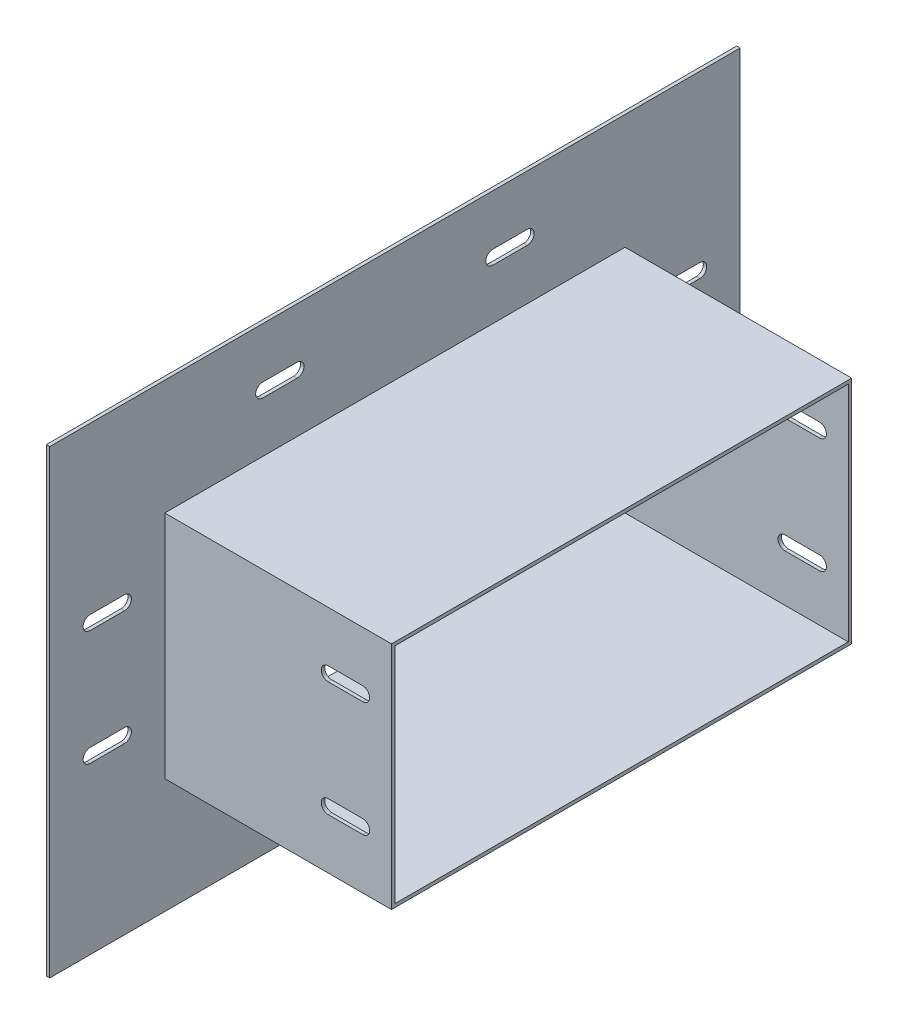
ISO-10303-21;
HEADER;
FILE_DESCRIPTION(('STEP AP214'),'2;1');
FILE_NAME('part.step','',(''),(''),'','','');
FILE_SCHEMA(('AUTOMOTIVE_DESIGN { 1 0 10303 214 1 1 1 1 }'));
ENDSEC;
DATA;
#1=APPLICATION_CONTEXT('core data for automotive mechanical design processes');
#2=APPLICATION_PROTOCOL_DEFINITION('international standard','automotive_design',2000,#1);
#3=PRODUCT_CONTEXT('',#1,'mechanical');
#4=PRODUCT('Part','Part','',(#3));
#5=PRODUCT_RELATED_PRODUCT_CATEGORY('part','',(#4));
#6=PRODUCT_DEFINITION_FORMATION('','',#4);
#7=PRODUCT_DEFINITION_CONTEXT('part definition',#1,'design');
#8=PRODUCT_DEFINITION('design','',#6,#7);
#9=PRODUCT_DEFINITION_SHAPE('','',#8);
#10=(LENGTH_UNIT() NAMED_UNIT(*) SI_UNIT(.MILLI.,.METRE.));
#11=(NAMED_UNIT(*) PLANE_ANGLE_UNIT() SI_UNIT($,.RADIAN.));
#12=(NAMED_UNIT(*) SI_UNIT($,.STERADIAN.) SOLID_ANGLE_UNIT());
#13=UNCERTAINTY_MEASURE_WITH_UNIT(LENGTH_MEASURE(1.E-05),#10,'distance_accuracy_value','');
#14=(GEOMETRIC_REPRESENTATION_CONTEXT(3) GLOBAL_UNCERTAINTY_ASSIGNED_CONTEXT((#13)) GLOBAL_UNIT_ASSIGNED_CONTEXT((#10,
#11,#12)) REPRESENTATION_CONTEXT('',''));
#15=CARTESIAN_POINT('',(0.,0.,0.));
#16=DIRECTION('',(0.,0.,1.));
#17=DIRECTION('',(1.,0.,0.));
#18=AXIS2_PLACEMENT_3D('',#15,#16,#17);
#19=CARTESIAN_POINT('',(100.,-50.,-100.));
#20=DIRECTION('',(0.,0.,1.));
#21=DIRECTION('',(1.,0.,0.));
#22=AXIS2_PLACEMENT_3D('',#19,#20,#21);
#23=PLANE('',#22);
#24=DIRECTION('',(-1.,0.,0.));
#25=VECTOR('',#24,1.);
#26=CARTESIAN_POINT('',(100.,-22.,-100.));
#27=LINE('',#26,#25);
#28=CARTESIAN_POINT('',(87.5,-22.,-100.));
#29=VERTEX_POINT('',#28);
#30=CARTESIAN_POINT('',(72.5,-22.,-100.));
#31=VERTEX_POINT('',#30);
#32=EDGE_CURVE('E727',#29,#31,#27,.T.);
#33=ORIENTED_EDGE('',*,*,#32,.T.);
#34=CARTESIAN_POINT('',(72.5,-25.,-100.));
#35=DIRECTION('',(0.,0.,1.));
#36=DIRECTION('',(1.,0.,0.));
#37=AXIS2_PLACEMENT_3D('',#34,#35,#36);
#38=CIRCLE('',#37,3.);
#39=CARTESIAN_POINT('',(72.5,-28.,-100.));
#40=VERTEX_POINT('',#39);
#41=EDGE_CURVE('E736',#31,#40,#38,.T.);
#42=ORIENTED_EDGE('',*,*,#41,.T.);
#43=DIRECTION('',(1.,0.,0.));
#44=VECTOR('',#43,1.);
#45=CARTESIAN_POINT('',(100.,-28.,-100.));
#46=LINE('',#45,#44);
#47=CARTESIAN_POINT('',(87.5,-28.,-100.));
#48=VERTEX_POINT('',#47);
#49=EDGE_CURVE('E711',#40,#48,#46,.T.);
#50=ORIENTED_EDGE('',*,*,#49,.T.);
#51=CARTESIAN_POINT('',(87.5,-25.,-100.));
#52=DIRECTION('',(0.,0.,1.));
#53=DIRECTION('',(1.,0.,0.));
#54=AXIS2_PLACEMENT_3D('',#51,#52,#53);
#55=CIRCLE('',#54,3.);
#56=EDGE_CURVE('E719',#48,#29,#55,.T.);
#57=ORIENTED_EDGE('',*,*,#56,.T.);
#58=EDGE_LOOP('',(#33,#42,#50,#57));
#59=FACE_BOUND('',#58,.T.);
#60=DIRECTION('',(-1.,0.,0.));
#61=VECTOR('',#60,1.);
#62=CARTESIAN_POINT('',(100.,28.,-100.));
#63=LINE('',#62,#61);
#64=CARTESIAN_POINT('',(87.5,28.,-100.));
#65=VERTEX_POINT('',#64);
#66=CARTESIAN_POINT('',(72.5,28.,-100.));
#67=VERTEX_POINT('',#66);
#68=EDGE_CURVE('E775',#65,#67,#63,.T.);
#69=ORIENTED_EDGE('',*,*,#68,.T.);
#70=CARTESIAN_POINT('',(72.5,25.,-100.));
#71=DIRECTION('',(0.,0.,1.));
#72=DIRECTION('',(1.,0.,0.));
#73=AXIS2_PLACEMENT_3D('',#70,#71,#72);
#74=CIRCLE('',#73,3.);
#75=CARTESIAN_POINT('',(72.5,22.,-100.));
#76=VERTEX_POINT('',#75);
#77=EDGE_CURVE('E784',#67,#76,#74,.T.);
#78=ORIENTED_EDGE('',*,*,#77,.T.);
#79=DIRECTION('',(1.,0.,0.));
#80=VECTOR('',#79,1.);
#81=CARTESIAN_POINT('',(100.,22.,-100.));
#82=LINE('',#81,#80);
#83=CARTESIAN_POINT('',(87.5,22.,-100.));
#84=VERTEX_POINT('',#83);
#85=EDGE_CURVE('E759',#76,#84,#82,.T.);
#86=ORIENTED_EDGE('',*,*,#85,.T.);
#87=CARTESIAN_POINT('',(87.5,25.,-100.));
#88=DIRECTION('',(0.,0.,1.));
#89=DIRECTION('',(1.,0.,0.));
#90=AXIS2_PLACEMENT_3D('',#87,#88,#89);
#91=CIRCLE('',#90,3.);
#92=EDGE_CURVE('E767',#84,#65,#91,.T.);
#93=ORIENTED_EDGE('',*,*,#92,.T.);
#94=EDGE_LOOP('',(#69,#78,#86,#93));
#95=FACE_BOUND('',#94,.T.);
#96=DIRECTION('',(0.,1.,0.));
#97=VECTOR('',#96,1.);
#98=CARTESIAN_POINT('',(1.5,50.,-100.));
#99=LINE('',#98,#97);
#100=CARTESIAN_POINT('',(1.5,-50.,-100.));
#101=VERTEX_POINT('',#100);
#102=CARTESIAN_POINT('',(1.5,50.,-100.));
#103=VERTEX_POINT('',#102);
#104=EDGE_CURVE('E794',#101,#103,#99,.T.);
#105=ORIENTED_EDGE('',*,*,#104,.T.);
#106=DIRECTION('',(-1.,0.,0.));
#107=VECTOR('',#106,1.);
#108=CARTESIAN_POINT('',(100.,50.,-100.));
#109=LINE('',#108,#107);
#110=CARTESIAN_POINT('',(100.,50.,-100.));
#111=VERTEX_POINT('',#110);
#112=EDGE_CURVE('E874',#111,#103,#109,.T.);
#113=ORIENTED_EDGE('',*,*,#112,.F.);
#114=DIRECTION('',(0.,1.,0.));
#115=VECTOR('',#114,1.);
#116=CARTESIAN_POINT('',(100.,-50.,-100.));
#117=LINE('',#116,#115);
#118=CARTESIAN_POINT('',(100.,-50.,-100.));
#119=VERTEX_POINT('',#118);
#120=EDGE_CURVE('E857',#119,#111,#117,.T.);
#121=ORIENTED_EDGE('',*,*,#120,.F.);
#122=DIRECTION('',(-1.,0.,0.));
#123=VECTOR('',#122,1.);
#124=CARTESIAN_POINT('',(100.,-50.,-100.));
#125=LINE('',#124,#123);
#126=EDGE_CURVE('E866',#119,#101,#125,.T.);
#127=ORIENTED_EDGE('',*,*,#126,.T.);
#128=EDGE_LOOP('',(#105,#113,#121,#127));
#129=FACE_BOUND('',#128,.T.);
#130=ADVANCED_FACE('F56',(#59,#95,#129),#23,.F.);
#131=CARTESIAN_POINT('',(100.,50.,-100.));
#132=DIRECTION('',(0.,-1.,0.));
#133=DIRECTION('',(0.,0.,-1.));
#134=AXIS2_PLACEMENT_3D('',#131,#132,#133);
#135=PLANE('',#134);
#136=DIRECTION('',(0.,0.,1.));
#137=VECTOR('',#136,1.);
#138=CARTESIAN_POINT('',(1.5,50.,100.));
#139=LINE('',#138,#137);
#140=CARTESIAN_POINT('',(1.5,50.,100.));
#141=VERTEX_POINT('',#140);
#142=EDGE_CURVE('E787',#103,#141,#139,.T.);
#143=ORIENTED_EDGE('',*,*,#142,.T.);
#144=DIRECTION('',(-1.,0.,0.));
#145=VECTOR('',#144,1.);
#146=CARTESIAN_POINT('',(100.,50.,100.));
#147=LINE('',#146,#145);
#148=CARTESIAN_POINT('',(100.,50.,100.));
#149=VERTEX_POINT('',#148);
#150=EDGE_CURVE('E871',#149,#141,#147,.T.);
#151=ORIENTED_EDGE('',*,*,#150,.F.);
#152=DIRECTION('',(0.,0.,1.));
#153=VECTOR('',#152,1.);
#154=CARTESIAN_POINT('',(100.,50.,-100.));
#155=LINE('',#154,#153);
#156=EDGE_CURVE('E860',#111,#149,#155,.T.);
#157=ORIENTED_EDGE('',*,*,#156,.F.);
#158=ORIENTED_EDGE('',*,*,#112,.T.);
#159=EDGE_LOOP('',(#143,#151,#157,#158));
#160=FACE_BOUND('',#159,.T.);
#161=ADVANCED_FACE('F914',(#160),#135,.F.);
#162=CARTESIAN_POINT('',(100.,-50.,100.));
#163=DIRECTION('',(0.,0.,-1.));
#164=DIRECTION('',(-1.,0.,0.));
#165=AXIS2_PLACEMENT_3D('',#162,#163,#164);
#166=PLANE('',#165);
#167=DIRECTION('',(-1.,0.,0.));
#168=VECTOR('',#167,1.);
#169=CARTESIAN_POINT('',(100.,-28.,100.));
#170=LINE('',#169,#168);
#171=CARTESIAN_POINT('',(87.5,-28.,100.));
#172=VERTEX_POINT('',#171);
#173=CARTESIAN_POINT('',(72.5,-28.,100.));
#174=VERTEX_POINT('',#173);
#175=EDGE_CURVE('E708',#172,#174,#170,.T.);
#176=ORIENTED_EDGE('',*,*,#175,.T.);
#177=CARTESIAN_POINT('',(72.5,-25.,100.));
#178=DIRECTION('',(0.,0.,-1.));
#179=DIRECTION('',(-1.,0.,0.));
#180=AXIS2_PLACEMENT_3D('',#177,#178,#179);
#181=CIRCLE('',#180,3.);
#182=CARTESIAN_POINT('',(72.5,-22.,100.));
#183=VERTEX_POINT('',#182);
#184=EDGE_CURVE('E733',#174,#183,#181,.T.);
#185=ORIENTED_EDGE('',*,*,#184,.T.);
#186=DIRECTION('',(1.,0.,0.));
#187=VECTOR('',#186,1.);
#188=CARTESIAN_POINT('',(100.,-22.,100.));
#189=LINE('',#188,#187);
#190=CARTESIAN_POINT('',(87.5,-22.,100.));
#191=VERTEX_POINT('',#190);
#192=EDGE_CURVE('E724',#183,#191,#189,.T.);
#193=ORIENTED_EDGE('',*,*,#192,.T.);
#194=CARTESIAN_POINT('',(87.5,-25.,100.));
#195=DIRECTION('',(0.,0.,-1.));
#196=DIRECTION('',(-1.,0.,0.));
#197=AXIS2_PLACEMENT_3D('',#194,#195,#196);
#198=CIRCLE('',#197,3.);
#199=EDGE_CURVE('E716',#191,#172,#198,.T.);
#200=ORIENTED_EDGE('',*,*,#199,.T.);
#201=EDGE_LOOP('',(#176,#185,#193,#200));
#202=FACE_BOUND('',#201,.T.);
#203=DIRECTION('',(-1.,0.,0.));
#204=VECTOR('',#203,1.);
#205=CARTESIAN_POINT('',(100.,22.,100.));
#206=LINE('',#205,#204);
#207=CARTESIAN_POINT('',(87.5,22.,100.));
#208=VERTEX_POINT('',#207);
#209=CARTESIAN_POINT('',(72.5,22.,100.));
#210=VERTEX_POINT('',#209);
#211=EDGE_CURVE('E756',#208,#210,#206,.T.);
#212=ORIENTED_EDGE('',*,*,#211,.T.);
#213=CARTESIAN_POINT('',(72.5,25.,100.));
#214=DIRECTION('',(0.,0.,-1.));
#215=DIRECTION('',(-1.,0.,0.));
#216=AXIS2_PLACEMENT_3D('',#213,#214,#215);
#217=CIRCLE('',#216,3.);
#218=CARTESIAN_POINT('',(72.5,28.,100.));
#219=VERTEX_POINT('',#218);
#220=EDGE_CURVE('E781',#210,#219,#217,.T.);
#221=ORIENTED_EDGE('',*,*,#220,.T.);
#222=DIRECTION('',(1.,0.,0.));
#223=VECTOR('',#222,1.);
#224=CARTESIAN_POINT('',(100.,28.,100.));
#225=LINE('',#224,#223);
#226=CARTESIAN_POINT('',(87.5,28.,100.));
#227=VERTEX_POINT('',#226);
#228=EDGE_CURVE('E772',#219,#227,#225,.T.);
#229=ORIENTED_EDGE('',*,*,#228,.T.);
#230=CARTESIAN_POINT('',(87.5,25.,100.));
#231=DIRECTION('',(0.,0.,-1.));
#232=DIRECTION('',(-1.,0.,0.));
#233=AXIS2_PLACEMENT_3D('',#230,#231,#232);
#234=CIRCLE('',#233,3.);
#235=EDGE_CURVE('E764',#227,#208,#234,.T.);
#236=ORIENTED_EDGE('',*,*,#235,.T.);
#237=EDGE_LOOP('',(#212,#221,#229,#236));
#238=FACE_BOUND('',#237,.T.);
#239=DIRECTION('',(0.,-1.,0.));
#240=VECTOR('',#239,1.);
#241=CARTESIAN_POINT('',(1.5,50.,100.));
#242=LINE('',#241,#240);
#243=CARTESIAN_POINT('',(1.5,-50.,100.));
#244=VERTEX_POINT('',#243);
#245=EDGE_CURVE('E789',#141,#244,#242,.T.);
#246=ORIENTED_EDGE('',*,*,#245,.T.);
#247=DIRECTION('',(-1.,0.,0.));
#248=VECTOR('',#247,1.);
#249=CARTESIAN_POINT('',(100.,-50.,100.));
#250=LINE('',#249,#248);
#251=CARTESIAN_POINT('',(100.,-50.,100.));
#252=VERTEX_POINT('',#251);
#253=EDGE_CURVE('E869',#252,#244,#250,.T.);
#254=ORIENTED_EDGE('',*,*,#253,.F.);
#255=DIRECTION('',(0.,-1.,0.));
#256=VECTOR('',#255,1.);
#257=CARTESIAN_POINT('',(100.,-50.,100.));
#258=LINE('',#257,#256);
#259=EDGE_CURVE('E862',#149,#252,#258,.T.);
#260=ORIENTED_EDGE('',*,*,#259,.F.);
#261=ORIENTED_EDGE('',*,*,#150,.T.);
#262=EDGE_LOOP('',(#246,#254,#260,#261));
#263=FACE_BOUND('',#262,.T.);
#264=ADVANCED_FACE('F910',(#202,#238,#263),#166,.F.);
#265=CARTESIAN_POINT('',(100.,-50.,-100.));
#266=DIRECTION('',(0.,1.,0.));
#267=DIRECTION('',(0.,0.,1.));
#268=AXIS2_PLACEMENT_3D('',#265,#266,#267);
#269=PLANE('',#268);
#270=DIRECTION('',(0.,0.,-1.));
#271=VECTOR('',#270,1.);
#272=CARTESIAN_POINT('',(1.5,-50.,-100.));
#273=LINE('',#272,#271);
#274=EDGE_CURVE('E792',#244,#101,#273,.T.);
#275=ORIENTED_EDGE('',*,*,#274,.T.);
#276=ORIENTED_EDGE('',*,*,#126,.F.);
#277=DIRECTION('',(0.,0.,-1.));
#278=VECTOR('',#277,1.);
#279=CARTESIAN_POINT('',(100.,-50.,-100.));
#280=LINE('',#279,#278);
#281=EDGE_CURVE('E864',#252,#119,#280,.T.);
#282=ORIENTED_EDGE('',*,*,#281,.F.);
#283=ORIENTED_EDGE('',*,*,#253,.T.);
#284=EDGE_LOOP('',(#275,#276,#282,#283));
#285=FACE_BOUND('',#284,.T.);
#286=ADVANCED_FACE('F913',(#285),#269,.F.);
#287=CARTESIAN_POINT('',(100.,0.,0.));
#288=DIRECTION('',(1.,0.,0.));
#289=DIRECTION('',(0.,0.,-1.));
#290=AXIS2_PLACEMENT_3D('',#287,#288,#289);
#291=PLANE('',#290);
#292=ORIENTED_EDGE('',*,*,#120,.T.);
#293=ORIENTED_EDGE('',*,*,#156,.T.);
#294=ORIENTED_EDGE('',*,*,#259,.T.);
#295=ORIENTED_EDGE('',*,*,#281,.T.);
#296=EDGE_LOOP('',(#292,#293,#294,#295));
#297=FACE_BOUND('',#296,.T.);
#298=DIRECTION('',(0.,0.,1.));
#299=VECTOR('',#298,1.);
#300=CARTESIAN_POINT('',(100.,48.5,-100.));
#301=LINE('',#300,#299);
#302=CARTESIAN_POINT('',(100.,48.5,-98.5));
#303=VERTEX_POINT('',#302);
#304=CARTESIAN_POINT('',(100.,48.5,98.5));
#305=VERTEX_POINT('',#304);
#306=EDGE_CURVE('E829',#303,#305,#301,.T.);
#307=ORIENTED_EDGE('',*,*,#306,.F.);
#308=DIRECTION('',(0.,1.,0.));
#309=VECTOR('',#308,1.);
#310=CARTESIAN_POINT('',(100.,-50.,-98.5));
#311=LINE('',#310,#309);
#312=CARTESIAN_POINT('',(100.,-48.5,-98.5));
#313=VERTEX_POINT('',#312);
#314=EDGE_CURVE('E827',#313,#303,#311,.T.);
#315=ORIENTED_EDGE('',*,*,#314,.F.);
#316=DIRECTION('',(0.,0.,-1.));
#317=VECTOR('',#316,1.);
#318=CARTESIAN_POINT('',(100.,-48.5,-100.));
#319=LINE('',#318,#317);
#320=CARTESIAN_POINT('',(100.,-48.5,98.5));
#321=VERTEX_POINT('',#320);
#322=EDGE_CURVE('E835',#321,#313,#319,.T.);
#323=ORIENTED_EDGE('',*,*,#322,.F.);
#324=DIRECTION('',(0.,-1.,0.));
#325=VECTOR('',#324,1.);
#326=CARTESIAN_POINT('',(100.,-50.,98.5));
#327=LINE('',#326,#325);
#328=EDGE_CURVE('E832',#305,#321,#327,.T.);
#329=ORIENTED_EDGE('',*,*,#328,.F.);
#330=EDGE_LOOP('',(#307,#315,#323,#329));
#331=FACE_BOUND('',#330,.T.);
#332=ADVANCED_FACE('F933',(#297,#331),#291,.T.);
#333=CARTESIAN_POINT('',(0.,0.,0.));
#334=DIRECTION('',(1.,0.,0.));
#335=DIRECTION('',(0.,0.,-1.));
#336=AXIS2_PLACEMENT_3D('',#333,#334,#335);
#337=PLANE('',#336);
#338=DIRECTION('',(0.,0.,1.));
#339=VECTOR('',#338,1.);
#340=CARTESIAN_POINT('',(0.,-22.,-117.5));
#341=LINE('',#340,#339);
#342=CARTESIAN_POINT('',(0.,-22.,-132.5));
#343=VERTEX_POINT('',#342);
#344=CARTESIAN_POINT('',(0.,-22.,-117.5));
#345=VERTEX_POINT('',#344);
#346=EDGE_CURVE('E439',#343,#345,#341,.T.);
#347=ORIENTED_EDGE('',*,*,#346,.T.);
#348=CARTESIAN_POINT('',(0.,-25.,-117.5));
#349=DIRECTION('',(1.,0.,0.));
#350=DIRECTION('',(0.,0.,-1.));
#351=AXIS2_PLACEMENT_3D('',#348,#349,#350);
#352=CIRCLE('',#351,3.);
#353=CARTESIAN_POINT('',(0.,-28.,-117.5));
#354=VERTEX_POINT('',#353);
#355=EDGE_CURVE('E433',#345,#354,#352,.T.);
#356=ORIENTED_EDGE('',*,*,#355,.T.);
#357=DIRECTION('',(0.,0.,-1.));
#358=VECTOR('',#357,1.);
#359=CARTESIAN_POINT('',(0.,-28.,-117.5));
#360=LINE('',#359,#358);
#361=CARTESIAN_POINT('',(0.,-28.,-132.5));
#362=VERTEX_POINT('',#361);
#363=EDGE_CURVE('E442',#354,#362,#360,.T.);
#364=ORIENTED_EDGE('',*,*,#363,.T.);
#365=CARTESIAN_POINT('',(0.,-25.,-132.5));
#366=DIRECTION('',(1.,0.,0.));
#367=DIRECTION('',(0.,0.,-1.));
#368=AXIS2_PLACEMENT_3D('',#365,#366,#367);
#369=CIRCLE('',#368,3.);
#370=EDGE_CURVE('E70',#362,#343,#369,.T.);
#371=ORIENTED_EDGE('',*,*,#370,.T.);
#372=EDGE_LOOP('',(#347,#356,#364,#371));
#373=FACE_BOUND('',#372,.T.);
#374=DIRECTION('',(0.,0.,1.));
#375=VECTOR('',#374,1.);
#376=CARTESIAN_POINT('',(0.,78.,-42.5));
#377=LINE('',#376,#375);
#378=CARTESIAN_POINT('',(0.,78.,-57.5));
#379=VERTEX_POINT('',#378);
#380=CARTESIAN_POINT('',(0.,78.,-42.5));
#381=VERTEX_POINT('',#380);
#382=EDGE_CURVE('E478',#379,#381,#377,.T.);
#383=ORIENTED_EDGE('',*,*,#382,.T.);
#384=CARTESIAN_POINT('',(0.,75.,-42.5));
#385=DIRECTION('',(1.,0.,0.));
#386=DIRECTION('',(0.,0.,-1.));
#387=AXIS2_PLACEMENT_3D('',#384,#385,#386);
#388=CIRCLE('',#387,3.00000000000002);
#389=CARTESIAN_POINT('',(0.,72.,-42.5));
#390=VERTEX_POINT('',#389);
#391=EDGE_CURVE('E468',#381,#390,#388,.T.);
#392=ORIENTED_EDGE('',*,*,#391,.T.);
#393=DIRECTION('',(0.,0.,-1.));
#394=VECTOR('',#393,1.);
#395=CARTESIAN_POINT('',(0.,72.,-42.5));
#396=LINE('',#395,#394);
#397=CARTESIAN_POINT('',(0.,72.,-57.5));
#398=VERTEX_POINT('',#397);
#399=EDGE_CURVE('E471',#390,#398,#396,.T.);
#400=ORIENTED_EDGE('',*,*,#399,.T.);
#401=CARTESIAN_POINT('',(0.,75.,-57.5));
#402=DIRECTION('',(1.,0.,0.));
#403=DIRECTION('',(0.,0.,-1.));
#404=AXIS2_PLACEMENT_3D('',#401,#402,#403);
#405=CIRCLE('',#404,3.00000000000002);
#406=EDGE_CURVE('E475',#398,#379,#405,.T.);
#407=ORIENTED_EDGE('',*,*,#406,.T.);
#408=EDGE_LOOP('',(#383,#392,#400,#407));
#409=FACE_BOUND('',#408,.T.);
#410=DIRECTION('',(0.,0.,1.));
#411=VECTOR('',#410,1.);
#412=CARTESIAN_POINT('',(0.,-72.,-42.5));
#413=LINE('',#412,#411);
#414=CARTESIAN_POINT('',(0.,-72.,-57.5));
#415=VERTEX_POINT('',#414);
#416=CARTESIAN_POINT('',(0.,-72.,-42.5));
#417=VERTEX_POINT('',#416);
#418=EDGE_CURVE('E510',#415,#417,#413,.T.);
#419=ORIENTED_EDGE('',*,*,#418,.T.);
#420=CARTESIAN_POINT('',(0.,-75.,-42.5));
#421=DIRECTION('',(1.,0.,0.));
#422=DIRECTION('',(0.,0.,-1.));
#423=AXIS2_PLACEMENT_3D('',#420,#421,#422);
#424=CIRCLE('',#423,2.99999999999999);
#425=CARTESIAN_POINT('',(0.,-78.,-42.5));
#426=VERTEX_POINT('',#425);
#427=EDGE_CURVE('E500',#417,#426,#424,.T.);
#428=ORIENTED_EDGE('',*,*,#427,.T.);
#429=DIRECTION('',(0.,0.,-1.));
#430=VECTOR('',#429,1.);
#431=CARTESIAN_POINT('',(0.,-78.,-42.5));
#432=LINE('',#431,#430);
#433=CARTESIAN_POINT('',(0.,-78.,-57.5));
#434=VERTEX_POINT('',#433);
#435=EDGE_CURVE('E503',#426,#434,#432,.T.);
#436=ORIENTED_EDGE('',*,*,#435,.T.);
#437=CARTESIAN_POINT('',(0.,-75.,-57.5));
#438=DIRECTION('',(1.,0.,0.));
#439=DIRECTION('',(0.,0.,-1.));
#440=AXIS2_PLACEMENT_3D('',#437,#438,#439);
#441=CIRCLE('',#440,2.99999999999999);
#442=EDGE_CURVE('E507',#434,#415,#441,.T.);
#443=ORIENTED_EDGE('',*,*,#442,.T.);
#444=EDGE_LOOP('',(#419,#428,#436,#443));
#445=FACE_BOUND('',#444,.T.);
#446=DIRECTION('',(0.,0.,1.));
#447=VECTOR('',#446,1.);
#448=CARTESIAN_POINT('',(0.,28.,-117.5));
#449=LINE('',#448,#447);
#450=CARTESIAN_POINT('',(0.,28.,-132.5));
#451=VERTEX_POINT('',#450);
#452=CARTESIAN_POINT('',(0.,28.,-117.5));
#453=VERTEX_POINT('',#452);
#454=EDGE_CURVE('E542',#451,#453,#449,.T.);
#455=ORIENTED_EDGE('',*,*,#454,.T.);
#456=CARTESIAN_POINT('',(0.,25.,-117.5));
#457=DIRECTION('',(1.,0.,0.));
#458=DIRECTION('',(0.,0.,-1.));
#459=AXIS2_PLACEMENT_3D('',#456,#457,#458);
#460=CIRCLE('',#459,3.);
#461=CARTESIAN_POINT('',(0.,22.,-117.5));
#462=VERTEX_POINT('',#461);
#463=EDGE_CURVE('E532',#453,#462,#460,.T.);
#464=ORIENTED_EDGE('',*,*,#463,.T.);
#465=DIRECTION('',(0.,0.,-1.));
#466=VECTOR('',#465,1.);
#467=CARTESIAN_POINT('',(0.,22.,-117.5));
#468=LINE('',#467,#466);
#469=CARTESIAN_POINT('',(0.,22.,-132.5));
#470=VERTEX_POINT('',#469);
#471=EDGE_CURVE('E535',#462,#470,#468,.T.);
#472=ORIENTED_EDGE('',*,*,#471,.T.);
#473=CARTESIAN_POINT('',(0.,25.,-132.5));
#474=DIRECTION('',(1.,0.,0.));
#475=DIRECTION('',(0.,0.,-1.));
#476=AXIS2_PLACEMENT_3D('',#473,#474,#475);
#477=CIRCLE('',#476,3.);
#478=EDGE_CURVE('E539',#470,#451,#477,.T.);
#479=ORIENTED_EDGE('',*,*,#478,.T.);
#480=EDGE_LOOP('',(#455,#464,#472,#479));
#481=FACE_BOUND('',#480,.T.);
#482=DIRECTION('',(0.,0.,1.));
#483=VECTOR('',#482,1.);
#484=CARTESIAN_POINT('',(0.,-72.,57.5));
#485=LINE('',#484,#483);
#486=CARTESIAN_POINT('',(0.,-72.,42.5));
#487=VERTEX_POINT('',#486);
#488=CARTESIAN_POINT('',(0.,-72.,57.5));
#489=VERTEX_POINT('',#488);
#490=EDGE_CURVE('E574',#487,#489,#485,.T.);
#491=ORIENTED_EDGE('',*,*,#490,.T.);
#492=CARTESIAN_POINT('',(0.,-75.,57.5));
#493=DIRECTION('',(1.,0.,0.));
#494=DIRECTION('',(0.,0.,-1.));
#495=AXIS2_PLACEMENT_3D('',#492,#493,#494);
#496=CIRCLE('',#495,2.99999999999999);
#497=CARTESIAN_POINT('',(0.,-78.,57.5));
#498=VERTEX_POINT('',#497);
#499=EDGE_CURVE('E564',#489,#498,#496,.T.);
#500=ORIENTED_EDGE('',*,*,#499,.T.);
#501=DIRECTION('',(0.,0.,-1.));
#502=VECTOR('',#501,1.);
#503=CARTESIAN_POINT('',(0.,-78.,57.5));
#504=LINE('',#503,#502);
#505=CARTESIAN_POINT('',(0.,-78.,42.5));
#506=VERTEX_POINT('',#505);
#507=EDGE_CURVE('E567',#498,#506,#504,.T.);
#508=ORIENTED_EDGE('',*,*,#507,.T.);
#509=CARTESIAN_POINT('',(0.,-75.,42.5));
#510=DIRECTION('',(1.,0.,0.));
#511=DIRECTION('',(0.,0.,-1.));
#512=AXIS2_PLACEMENT_3D('',#509,#510,#511);
#513=CIRCLE('',#512,2.99999999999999);
#514=EDGE_CURVE('E571',#506,#487,#513,.T.);
#515=ORIENTED_EDGE('',*,*,#514,.T.);
#516=EDGE_LOOP('',(#491,#500,#508,#515));
#517=FACE_BOUND('',#516,.T.);
#518=DIRECTION('',(0.,0.,1.));
#519=VECTOR('',#518,1.);
#520=CARTESIAN_POINT('',(0.,28.,132.5));
#521=LINE('',#520,#519);
#522=CARTESIAN_POINT('',(0.,28.,117.5));
#523=VERTEX_POINT('',#522);
#524=CARTESIAN_POINT('',(0.,28.,132.5));
#525=VERTEX_POINT('',#524);
#526=EDGE_CURVE('E606',#523,#525,#521,.T.);
#527=ORIENTED_EDGE('',*,*,#526,.T.);
#528=CARTESIAN_POINT('',(0.,25.,132.5));
#529=DIRECTION('',(1.,0.,0.));
#530=DIRECTION('',(0.,0.,-1.));
#531=AXIS2_PLACEMENT_3D('',#528,#529,#530);
#532=CIRCLE('',#531,3.);
#533=CARTESIAN_POINT('',(0.,22.,132.5));
#534=VERTEX_POINT('',#533);
#535=EDGE_CURVE('E596',#525,#534,#532,.T.);
#536=ORIENTED_EDGE('',*,*,#535,.T.);
#537=DIRECTION('',(0.,0.,-1.));
#538=VECTOR('',#537,1.);
#539=CARTESIAN_POINT('',(0.,22.,132.5));
#540=LINE('',#539,#538);
#541=CARTESIAN_POINT('',(0.,22.,117.5));
#542=VERTEX_POINT('',#541);
#543=EDGE_CURVE('E599',#534,#542,#540,.T.);
#544=ORIENTED_EDGE('',*,*,#543,.T.);
#545=CARTESIAN_POINT('',(0.,25.,117.5));
#546=DIRECTION('',(1.,0.,0.));
#547=DIRECTION('',(0.,0.,-1.));
#548=AXIS2_PLACEMENT_3D('',#545,#546,#547);
#549=CIRCLE('',#548,3.);
#550=EDGE_CURVE('E603',#542,#523,#549,.T.);
#551=ORIENTED_EDGE('',*,*,#550,.T.);
#552=EDGE_LOOP('',(#527,#536,#544,#551));
#553=FACE_BOUND('',#552,.T.);
#554=DIRECTION('',(0.,0.,1.));
#555=VECTOR('',#554,1.);
#556=CARTESIAN_POINT('',(0.,-22.,132.5));
#557=LINE('',#556,#555);
#558=CARTESIAN_POINT('',(0.,-22.,117.5));
#559=VERTEX_POINT('',#558);
#560=CARTESIAN_POINT('',(0.,-22.,132.5));
#561=VERTEX_POINT('',#560);
#562=EDGE_CURVE('E638',#559,#561,#557,.T.);
#563=ORIENTED_EDGE('',*,*,#562,.T.);
#564=CARTESIAN_POINT('',(0.,-25.,132.5));
#565=DIRECTION('',(1.,0.,0.));
#566=DIRECTION('',(0.,0.,-1.));
#567=AXIS2_PLACEMENT_3D('',#564,#565,#566);
#568=CIRCLE('',#567,3.);
#569=CARTESIAN_POINT('',(0.,-28.,132.5));
#570=VERTEX_POINT('',#569);
#571=EDGE_CURVE('E628',#561,#570,#568,.T.);
#572=ORIENTED_EDGE('',*,*,#571,.T.);
#573=DIRECTION('',(0.,0.,-1.));
#574=VECTOR('',#573,1.);
#575=CARTESIAN_POINT('',(0.,-28.,132.5));
#576=LINE('',#575,#574);
#577=CARTESIAN_POINT('',(0.,-28.,117.5));
#578=VERTEX_POINT('',#577);
#579=EDGE_CURVE('E631',#570,#578,#576,.T.);
#580=ORIENTED_EDGE('',*,*,#579,.T.);
#581=CARTESIAN_POINT('',(0.,-25.,117.5));
#582=DIRECTION('',(1.,0.,0.));
#583=DIRECTION('',(0.,0.,-1.));
#584=AXIS2_PLACEMENT_3D('',#581,#582,#583);
#585=CIRCLE('',#584,3.);
#586=EDGE_CURVE('E635',#578,#559,#585,.T.);
#587=ORIENTED_EDGE('',*,*,#586,.T.);
#588=EDGE_LOOP('',(#563,#572,#580,#587));
#589=FACE_BOUND('',#588,.T.);
#590=DIRECTION('',(0.,0.,1.));
#591=VECTOR('',#590,1.);
#592=CARTESIAN_POINT('',(0.,78.,57.5));
#593=LINE('',#592,#591);
#594=CARTESIAN_POINT('',(0.,78.,42.5));
#595=VERTEX_POINT('',#594);
#596=CARTESIAN_POINT('',(0.,78.,57.5));
#597=VERTEX_POINT('',#596);
#598=EDGE_CURVE('E670',#595,#597,#593,.T.);
#599=ORIENTED_EDGE('',*,*,#598,.T.);
#600=CARTESIAN_POINT('',(0.,75.,57.5));
#601=DIRECTION('',(1.,0.,0.));
#602=DIRECTION('',(0.,0.,-1.));
#603=AXIS2_PLACEMENT_3D('',#600,#601,#602);
#604=CIRCLE('',#603,3.00000000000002);
#605=CARTESIAN_POINT('',(0.,72.,57.5));
#606=VERTEX_POINT('',#605);
#607=EDGE_CURVE('E660',#597,#606,#604,.T.);
#608=ORIENTED_EDGE('',*,*,#607,.T.);
#609=DIRECTION('',(0.,0.,-1.));
#610=VECTOR('',#609,1.);
#611=CARTESIAN_POINT('',(0.,72.,57.5));
#612=LINE('',#611,#610);
#613=CARTESIAN_POINT('',(0.,72.,42.5));
#614=VERTEX_POINT('',#613);
#615=EDGE_CURVE('E663',#606,#614,#612,.T.);
#616=ORIENTED_EDGE('',*,*,#615,.T.);
#617=CARTESIAN_POINT('',(0.,75.,42.5));
#618=DIRECTION('',(1.,0.,0.));
#619=DIRECTION('',(0.,0.,-1.));
#620=AXIS2_PLACEMENT_3D('',#617,#618,#619);
#621=CIRCLE('',#620,3.00000000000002);
#622=EDGE_CURVE('E667',#614,#595,#621,.T.);
#623=ORIENTED_EDGE('',*,*,#622,.T.);
#624=EDGE_LOOP('',(#599,#608,#616,#623));
#625=FACE_BOUND('',#624,.T.);
#626=DIRECTION('',(0.,1.,0.));
#627=VECTOR('',#626,1.);
#628=CARTESIAN_POINT('',(0.,-50.,-98.5));
#629=LINE('',#628,#627);
#630=CARTESIAN_POINT('',(0.,-48.5,-98.5));
#631=VERTEX_POINT('',#630);
#632=CARTESIAN_POINT('',(0.,48.5,-98.5));
#633=VERTEX_POINT('',#632);
#634=EDGE_CURVE('E826',#631,#633,#629,.T.);
#635=ORIENTED_EDGE('',*,*,#634,.T.);
#636=DIRECTION('',(0.,0.,1.));
#637=VECTOR('',#636,1.);
#638=CARTESIAN_POINT('',(0.,48.5,-100.));
#639=LINE('',#638,#637);
#640=CARTESIAN_POINT('',(0.,48.5,98.5));
#641=VERTEX_POINT('',#640);
#642=EDGE_CURVE('E840',#633,#641,#639,.T.);
#643=ORIENTED_EDGE('',*,*,#642,.T.);
#644=DIRECTION('',(0.,-1.,0.));
#645=VECTOR('',#644,1.);
#646=CARTESIAN_POINT('',(0.,-50.,98.5));
#647=LINE('',#646,#645);
#648=CARTESIAN_POINT('',(0.,-48.5,98.5));
#649=VERTEX_POINT('',#648);
#650=EDGE_CURVE('E843',#641,#649,#647,.T.);
#651=ORIENTED_EDGE('',*,*,#650,.T.);
#652=DIRECTION('',(0.,0.,-1.));
#653=VECTOR('',#652,1.);
#654=CARTESIAN_POINT('',(0.,-48.5,-100.));
#655=LINE('',#654,#653);
#656=EDGE_CURVE('E830',#649,#631,#655,.T.);
#657=ORIENTED_EDGE('',*,*,#656,.T.);
#658=EDGE_LOOP('',(#635,#643,#651,#657));
#659=FACE_BOUND('',#658,.T.);
#660=DIRECTION('',(0.,0.,1.));
#661=VECTOR('',#660,1.);
#662=CARTESIAN_POINT('',(0.,100.,150.));
#663=LINE('',#662,#661);
#664=CARTESIAN_POINT('',(0.,100.,-150.));
#665=VERTEX_POINT('',#664);
#666=CARTESIAN_POINT('',(0.,100.,150.));
#667=VERTEX_POINT('',#666);
#668=EDGE_CURVE('E796',#665,#667,#663,.T.);
#669=ORIENTED_EDGE('',*,*,#668,.F.);
#670=DIRECTION('',(0.,1.,0.));
#671=VECTOR('',#670,1.);
#672=CARTESIAN_POINT('',(0.,100.,-150.));
#673=LINE('',#672,#671);
#674=CARTESIAN_POINT('',(0.,-100.,-150.));
#675=VERTEX_POINT('',#674);
#676=EDGE_CURVE('E801',#675,#665,#673,.T.);
#677=ORIENTED_EDGE('',*,*,#676,.F.);
#678=DIRECTION('',(0.,0.,-1.));
#679=VECTOR('',#678,1.);
#680=CARTESIAN_POINT('',(0.,-100.,-150.));
#681=LINE('',#680,#679);
#682=CARTESIAN_POINT('',(0.,-100.,150.));
#683=VERTEX_POINT('',#682);
#684=EDGE_CURVE('E812',#683,#675,#681,.T.);
#685=ORIENTED_EDGE('',*,*,#684,.F.);
#686=DIRECTION('',(0.,-1.,0.));
#687=VECTOR('',#686,1.);
#688=CARTESIAN_POINT('',(0.,100.,150.));
#689=LINE('',#688,#687);
#690=EDGE_CURVE('E810',#667,#683,#689,.T.);
#691=ORIENTED_EDGE('',*,*,#690,.F.);
#692=EDGE_LOOP('',(#669,#677,#685,#691));
#693=FACE_BOUND('',#692,.T.);
#694=ADVANCED_FACE('F446',(#373,#409,#445,#481,#517,#553,#589,#625,#659,#693),#337,.F.);
#695=CARTESIAN_POINT('',(100.,-50.,-98.5));
#696=DIRECTION('',(0.,0.,1.));
#697=DIRECTION('',(1.,0.,0.));
#698=AXIS2_PLACEMENT_3D('',#695,#696,#697);
#699=PLANE('',#698);
#700=CARTESIAN_POINT('',(72.5,-25.,-98.5));
#701=DIRECTION('',(0.,0.,1.));
#702=DIRECTION('',(1.,0.,0.));
#703=AXIS2_PLACEMENT_3D('',#700,#701,#702);
#704=CIRCLE('',#703,3.);
#705=CARTESIAN_POINT('',(72.5,-22.,-98.5));
#706=VERTEX_POINT('',#705);
#707=CARTESIAN_POINT('',(72.5,-28.,-98.5));
#708=VERTEX_POINT('',#707);
#709=EDGE_CURVE('E730',#706,#708,#704,.T.);
#710=ORIENTED_EDGE('',*,*,#709,.F.);
#711=DIRECTION('',(-1.,0.,0.));
#712=VECTOR('',#711,1.);
#713=CARTESIAN_POINT('',(100.,-22.,-98.5));
#714=LINE('',#713,#712);
#715=CARTESIAN_POINT('',(87.5,-22.,-98.5));
#716=VERTEX_POINT('',#715);
#717=EDGE_CURVE('E722',#716,#706,#714,.T.);
#718=ORIENTED_EDGE('',*,*,#717,.F.);
#719=CARTESIAN_POINT('',(87.5,-25.,-98.5));
#720=DIRECTION('',(0.,0.,1.));
#721=DIRECTION('',(1.,0.,0.));
#722=AXIS2_PLACEMENT_3D('',#719,#720,#721);
#723=CIRCLE('',#722,3.);
#724=CARTESIAN_POINT('',(87.5,-28.,-98.5));
#725=VERTEX_POINT('',#724);
#726=EDGE_CURVE('E714',#725,#716,#723,.T.);
#727=ORIENTED_EDGE('',*,*,#726,.F.);
#728=DIRECTION('',(1.,0.,0.));
#729=VECTOR('',#728,1.);
#730=CARTESIAN_POINT('',(100.,-28.,-98.5));
#731=LINE('',#730,#729);
#732=EDGE_CURVE('E706',#708,#725,#731,.T.);
#733=ORIENTED_EDGE('',*,*,#732,.F.);
#734=EDGE_LOOP('',(#710,#718,#727,#733));
#735=FACE_BOUND('',#734,.T.);
#736=CARTESIAN_POINT('',(72.5,25.,-98.5));
#737=DIRECTION('',(0.,0.,1.));
#738=DIRECTION('',(1.,0.,0.));
#739=AXIS2_PLACEMENT_3D('',#736,#737,#738);
#740=CIRCLE('',#739,3.);
#741=CARTESIAN_POINT('',(72.5,28.,-98.5));
#742=VERTEX_POINT('',#741);
#743=CARTESIAN_POINT('',(72.5,22.,-98.5));
#744=VERTEX_POINT('',#743);
#745=EDGE_CURVE('E778',#742,#744,#740,.T.);
#746=ORIENTED_EDGE('',*,*,#745,.F.);
#747=DIRECTION('',(-1.,0.,0.));
#748=VECTOR('',#747,1.);
#749=CARTESIAN_POINT('',(100.,28.,-98.5));
#750=LINE('',#749,#748);
#751=CARTESIAN_POINT('',(87.5,28.,-98.5));
#752=VERTEX_POINT('',#751);
#753=EDGE_CURVE('E770',#752,#742,#750,.T.);
#754=ORIENTED_EDGE('',*,*,#753,.F.);
#755=CARTESIAN_POINT('',(87.5,25.,-98.5));
#756=DIRECTION('',(0.,0.,1.));
#757=DIRECTION('',(1.,0.,0.));
#758=AXIS2_PLACEMENT_3D('',#755,#756,#757);
#759=CIRCLE('',#758,3.);
#760=CARTESIAN_POINT('',(87.5,22.,-98.5));
#761=VERTEX_POINT('',#760);
#762=EDGE_CURVE('E762',#761,#752,#759,.T.);
#763=ORIENTED_EDGE('',*,*,#762,.F.);
#764=DIRECTION('',(1.,0.,0.));
#765=VECTOR('',#764,1.);
#766=CARTESIAN_POINT('',(100.,22.,-98.5));
#767=LINE('',#766,#765);
#768=EDGE_CURVE('E754',#744,#761,#767,.T.);
#769=ORIENTED_EDGE('',*,*,#768,.F.);
#770=EDGE_LOOP('',(#746,#754,#763,#769));
#771=FACE_BOUND('',#770,.T.);
#772=ORIENTED_EDGE('',*,*,#634,.F.);
#773=DIRECTION('',(-1.,0.,0.));
#774=VECTOR('',#773,1.);
#775=CARTESIAN_POINT('',(100.,-48.5,-98.5));
#776=LINE('',#775,#774);
#777=EDGE_CURVE('E837',#313,#631,#776,.T.);
#778=ORIENTED_EDGE('',*,*,#777,.F.);
#779=ORIENTED_EDGE('',*,*,#314,.T.);
#780=DIRECTION('',(-1.,0.,0.));
#781=VECTOR('',#780,1.);
#782=CARTESIAN_POINT('',(100.,48.5,-98.5));
#783=LINE('',#782,#781);
#784=EDGE_CURVE('E854',#303,#633,#783,.T.);
#785=ORIENTED_EDGE('',*,*,#784,.T.);
#786=EDGE_LOOP('',(#772,#778,#779,#785));
#787=FACE_BOUND('',#786,.T.);
#788=ADVANCED_FACE('F946',(#735,#771,#787),#699,.T.);
#789=CARTESIAN_POINT('',(100.,48.5,-100.));
#790=DIRECTION('',(0.,-1.,0.));
#791=DIRECTION('',(0.,0.,-1.));
#792=AXIS2_PLACEMENT_3D('',#789,#790,#791);
#793=PLANE('',#792);
#794=ORIENTED_EDGE('',*,*,#642,.F.);
#795=ORIENTED_EDGE('',*,*,#784,.F.);
#796=ORIENTED_EDGE('',*,*,#306,.T.);
#797=DIRECTION('',(-1.,0.,0.));
#798=VECTOR('',#797,1.);
#799=CARTESIAN_POINT('',(100.,48.5,98.5));
#800=LINE('',#799,#798);
#801=EDGE_CURVE('E852',#305,#641,#800,.T.);
#802=ORIENTED_EDGE('',*,*,#801,.T.);
#803=EDGE_LOOP('',(#794,#795,#796,#802));
#804=FACE_BOUND('',#803,.T.);
#805=ADVANCED_FACE('F951',(#804),#793,.T.);
#806=CARTESIAN_POINT('',(100.,-50.,98.5));
#807=DIRECTION('',(0.,0.,-1.));
#808=DIRECTION('',(-1.,0.,0.));
#809=AXIS2_PLACEMENT_3D('',#806,#807,#808);
#810=PLANE('',#809);
#811=CARTESIAN_POINT('',(72.5,-25.,98.5));
#812=DIRECTION('',(0.,0.,-1.));
#813=DIRECTION('',(-1.,0.,0.));
#814=AXIS2_PLACEMENT_3D('',#811,#812,#813);
#815=CIRCLE('',#814,3.);
#816=CARTESIAN_POINT('',(72.5,-28.,98.5));
#817=VERTEX_POINT('',#816);
#818=CARTESIAN_POINT('',(72.5,-22.,98.5));
#819=VERTEX_POINT('',#818);
#820=EDGE_CURVE('E12',#817,#819,#815,.T.);
#821=ORIENTED_EDGE('',*,*,#820,.F.);
#822=DIRECTION('',(-1.,0.,0.));
#823=VECTOR('',#822,1.);
#824=CARTESIAN_POINT('',(100.,-28.,98.5));
#825=LINE('',#824,#823);
#826=CARTESIAN_POINT('',(87.5,-28.,98.5));
#827=VERTEX_POINT('',#826);
#828=EDGE_CURVE('E886',#827,#817,#825,.T.);
#829=ORIENTED_EDGE('',*,*,#828,.F.);
#830=CARTESIAN_POINT('',(87.5,-25.,98.5));
#831=DIRECTION('',(0.,0.,-1.));
#832=DIRECTION('',(-1.,0.,0.));
#833=AXIS2_PLACEMENT_3D('',#830,#831,#832);
#834=CIRCLE('',#833,3.);
#835=CARTESIAN_POINT('',(87.5,-22.,98.5));
#836=VERTEX_POINT('',#835);
#837=EDGE_CURVE('E888',#836,#827,#834,.T.);
#838=ORIENTED_EDGE('',*,*,#837,.F.);
#839=DIRECTION('',(1.,0.,0.));
#840=VECTOR('',#839,1.);
#841=CARTESIAN_POINT('',(100.,-22.,98.5));
#842=LINE('',#841,#840);
#843=EDGE_CURVE('E63',#819,#836,#842,.T.);
#844=ORIENTED_EDGE('',*,*,#843,.F.);
#845=EDGE_LOOP('',(#821,#829,#838,#844));
#846=FACE_BOUND('',#845,.T.);
#847=CARTESIAN_POINT('',(72.5,25.,98.5));
#848=DIRECTION('',(0.,0.,-1.));
#849=DIRECTION('',(-1.,0.,0.));
#850=AXIS2_PLACEMENT_3D('',#847,#848,#849);
#851=CIRCLE('',#850,3.);
#852=CARTESIAN_POINT('',(72.5,22.,98.5));
#853=VERTEX_POINT('',#852);
#854=CARTESIAN_POINT('',(72.5,28.,98.5));
#855=VERTEX_POINT('',#854);
#856=EDGE_CURVE('E884',#853,#855,#851,.T.);
#857=ORIENTED_EDGE('',*,*,#856,.F.);
#858=DIRECTION('',(-1.,0.,0.));
#859=VECTOR('',#858,1.);
#860=CARTESIAN_POINT('',(100.,22.,98.5));
#861=LINE('',#860,#859);
#862=CARTESIAN_POINT('',(87.5,22.,98.5));
#863=VERTEX_POINT('',#862);
#864=EDGE_CURVE('E877',#863,#853,#861,.T.);
#865=ORIENTED_EDGE('',*,*,#864,.F.);
#866=CARTESIAN_POINT('',(87.5,25.,98.5));
#867=DIRECTION('',(0.,0.,-1.));
#868=DIRECTION('',(-1.,0.,0.));
#869=AXIS2_PLACEMENT_3D('',#866,#867,#868);
#870=CIRCLE('',#869,3.);
#871=CARTESIAN_POINT('',(87.5,28.,98.5));
#872=VERTEX_POINT('',#871);
#873=EDGE_CURVE('E879',#872,#863,#870,.T.);
#874=ORIENTED_EDGE('',*,*,#873,.F.);
#875=DIRECTION('',(1.,0.,0.));
#876=VECTOR('',#875,1.);
#877=CARTESIAN_POINT('',(100.,28.,98.5));
#878=LINE('',#877,#876);
#879=EDGE_CURVE('E882',#855,#872,#878,.T.);
#880=ORIENTED_EDGE('',*,*,#879,.F.);
#881=EDGE_LOOP('',(#857,#865,#874,#880));
#882=FACE_BOUND('',#881,.T.);
#883=ORIENTED_EDGE('',*,*,#650,.F.);
#884=ORIENTED_EDGE('',*,*,#801,.F.);
#885=ORIENTED_EDGE('',*,*,#328,.T.);
#886=DIRECTION('',(-1.,0.,0.));
#887=VECTOR('',#886,1.);
#888=CARTESIAN_POINT('',(100.,-48.5,98.5));
#889=LINE('',#888,#887);
#890=EDGE_CURVE('E850',#321,#649,#889,.T.);
#891=ORIENTED_EDGE('',*,*,#890,.T.);
#892=EDGE_LOOP('',(#883,#884,#885,#891));
#893=FACE_BOUND('',#892,.T.);
#894=ADVANCED_FACE('F901',(#846,#882,#893),#810,.T.);
#895=CARTESIAN_POINT('',(100.,-48.5,-100.));
#896=DIRECTION('',(0.,1.,0.));
#897=DIRECTION('',(0.,0.,1.));
#898=AXIS2_PLACEMENT_3D('',#895,#896,#897);
#899=PLANE('',#898);
#900=ORIENTED_EDGE('',*,*,#656,.F.);
#901=ORIENTED_EDGE('',*,*,#890,.F.);
#902=ORIENTED_EDGE('',*,*,#322,.T.);
#903=ORIENTED_EDGE('',*,*,#777,.T.);
#904=EDGE_LOOP('',(#900,#901,#902,#903));
#905=FACE_BOUND('',#904,.T.);
#906=ADVANCED_FACE('F958',(#905),#899,.T.);
#907=CARTESIAN_POINT('',(1.5,0.,0.));
#908=DIRECTION('',(-1.,0.,0.));
#909=DIRECTION('',(0.,0.,1.));
#910=AXIS2_PLACEMENT_3D('',#907,#908,#909);
#911=PLANE('',#910);
#912=DIRECTION('',(0.,0.,-1.));
#913=VECTOR('',#912,1.);
#914=CARTESIAN_POINT('',(1.5,-28.,-117.5));
#915=LINE('',#914,#913);
#916=CARTESIAN_POINT('',(1.5,-28.,-117.5));
#917=VERTEX_POINT('',#916);
#918=CARTESIAN_POINT('',(1.5,-28.,-132.5));
#919=VERTEX_POINT('',#918);
#920=EDGE_CURVE('E458',#917,#919,#915,.T.);
#921=ORIENTED_EDGE('',*,*,#920,.F.);
#922=CARTESIAN_POINT('',(1.5,-25.,-117.5));
#923=DIRECTION('',(1.,0.,0.));
#924=DIRECTION('',(0.,0.,-1.));
#925=AXIS2_PLACEMENT_3D('',#922,#923,#924);
#926=CIRCLE('',#925,3.);
#927=CARTESIAN_POINT('',(1.5,-22.,-117.5));
#928=VERTEX_POINT('',#927);
#929=EDGE_CURVE('E78',#928,#917,#926,.T.);
#930=ORIENTED_EDGE('',*,*,#929,.F.);
#931=DIRECTION('',(0.,0.,1.));
#932=VECTOR('',#931,1.);
#933=CARTESIAN_POINT('',(1.5,-22.,-117.5));
#934=LINE('',#933,#932);
#935=CARTESIAN_POINT('',(1.5,-22.,-132.5));
#936=VERTEX_POINT('',#935);
#937=EDGE_CURVE('E449',#936,#928,#934,.T.);
#938=ORIENTED_EDGE('',*,*,#937,.F.);
#939=CARTESIAN_POINT('',(1.5,-25.,-132.5));
#940=DIRECTION('',(1.,0.,0.));
#941=DIRECTION('',(0.,0.,-1.));
#942=AXIS2_PLACEMENT_3D('',#939,#940,#941);
#943=CIRCLE('',#942,3.);
#944=EDGE_CURVE('E452',#919,#936,#943,.T.);
#945=ORIENTED_EDGE('',*,*,#944,.F.);
#946=EDGE_LOOP('',(#921,#930,#938,#945));
#947=FACE_BOUND('',#946,.T.);
#948=DIRECTION('',(0.,0.,-1.));
#949=VECTOR('',#948,1.);
#950=CARTESIAN_POINT('',(1.5,72.,-42.5));
#951=LINE('',#950,#949);
#952=CARTESIAN_POINT('',(1.5,72.,-42.5));
#953=VERTEX_POINT('',#952);
#954=CARTESIAN_POINT('',(1.5,72.,-57.5));
#955=VERTEX_POINT('',#954);
#956=EDGE_CURVE('E483',#953,#955,#951,.T.);
#957=ORIENTED_EDGE('',*,*,#956,.F.);
#958=CARTESIAN_POINT('',(1.5,75.,-42.5));
#959=DIRECTION('',(1.,0.,0.));
#960=DIRECTION('',(0.,0.,-1.));
#961=AXIS2_PLACEMENT_3D('',#958,#959,#960);
#962=CIRCLE('',#961,3.00000000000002);
#963=CARTESIAN_POINT('',(1.5,78.,-42.5));
#964=VERTEX_POINT('',#963);
#965=EDGE_CURVE('E464',#964,#953,#962,.T.);
#966=ORIENTED_EDGE('',*,*,#965,.F.);
#967=DIRECTION('',(0.,0.,1.));
#968=VECTOR('',#967,1.);
#969=CARTESIAN_POINT('',(1.5,78.,-42.5));
#970=LINE('',#969,#968);
#971=CARTESIAN_POINT('',(1.5,78.,-57.5));
#972=VERTEX_POINT('',#971);
#973=EDGE_CURVE('E472',#972,#964,#970,.T.);
#974=ORIENTED_EDGE('',*,*,#973,.F.);
#975=CARTESIAN_POINT('',(1.5,75.,-57.5));
#976=DIRECTION('',(1.,0.,0.));
#977=DIRECTION('',(0.,0.,-1.));
#978=AXIS2_PLACEMENT_3D('',#975,#976,#977);
#979=CIRCLE('',#978,3.00000000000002);
#980=EDGE_CURVE('E486',#955,#972,#979,.T.);
#981=ORIENTED_EDGE('',*,*,#980,.F.);
#982=EDGE_LOOP('',(#957,#966,#974,#981));
#983=FACE_BOUND('',#982,.T.);
#984=DIRECTION('',(0.,0.,-1.));
#985=VECTOR('',#984,1.);
#986=CARTESIAN_POINT('',(1.5,-78.,-42.5));
#987=LINE('',#986,#985);
#988=CARTESIAN_POINT('',(1.5,-78.,-42.5));
#989=VERTEX_POINT('',#988);
#990=CARTESIAN_POINT('',(1.5,-78.,-57.5));
#991=VERTEX_POINT('',#990);
#992=EDGE_CURVE('E515',#989,#991,#987,.T.);
#993=ORIENTED_EDGE('',*,*,#992,.F.);
#994=CARTESIAN_POINT('',(1.5,-75.,-42.5));
#995=DIRECTION('',(1.,0.,0.));
#996=DIRECTION('',(0.,0.,-1.));
#997=AXIS2_PLACEMENT_3D('',#994,#995,#996);
#998=CIRCLE('',#997,2.99999999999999);
#999=CARTESIAN_POINT('',(1.5,-72.,-42.5));
#1000=VERTEX_POINT('',#999);
#1001=EDGE_CURVE('E493',#1000,#989,#998,.T.);
#1002=ORIENTED_EDGE('',*,*,#1001,.F.);
#1003=DIRECTION('',(0.,0.,1.));
#1004=VECTOR('',#1003,1.);
#1005=CARTESIAN_POINT('',(1.5,-72.,-42.5));
#1006=LINE('',#1005,#1004);
#1007=CARTESIAN_POINT('',(1.5,-72.,-57.5));
#1008=VERTEX_POINT('',#1007);
#1009=EDGE_CURVE('E504',#1008,#1000,#1006,.T.);
#1010=ORIENTED_EDGE('',*,*,#1009,.F.);
#1011=CARTESIAN_POINT('',(1.5,-75.,-57.5));
#1012=DIRECTION('',(1.,0.,0.));
#1013=DIRECTION('',(0.,0.,-1.));
#1014=AXIS2_PLACEMENT_3D('',#1011,#1012,#1013);
#1015=CIRCLE('',#1014,2.99999999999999);
#1016=EDGE_CURVE('E518',#991,#1008,#1015,.T.);
#1017=ORIENTED_EDGE('',*,*,#1016,.F.);
#1018=EDGE_LOOP('',(#993,#1002,#1010,#1017));
#1019=FACE_BOUND('',#1018,.T.);
#1020=DIRECTION('',(0.,0.,-1.));
#1021=VECTOR('',#1020,1.);
#1022=CARTESIAN_POINT('',(1.5,22.,-117.5));
#1023=LINE('',#1022,#1021);
#1024=CARTESIAN_POINT('',(1.5,22.,-117.5));
#1025=VERTEX_POINT('',#1024);
#1026=CARTESIAN_POINT('',(1.5,22.,-132.5));
#1027=VERTEX_POINT('',#1026);
#1028=EDGE_CURVE('E547',#1025,#1027,#1023,.T.);
#1029=ORIENTED_EDGE('',*,*,#1028,.F.);
#1030=CARTESIAN_POINT('',(1.5,25.,-117.5));
#1031=DIRECTION('',(1.,0.,0.));
#1032=DIRECTION('',(0.,0.,-1.));
#1033=AXIS2_PLACEMENT_3D('',#1030,#1031,#1032);
#1034=CIRCLE('',#1033,3.);
#1035=CARTESIAN_POINT('',(1.5,28.,-117.5));
#1036=VERTEX_POINT('',#1035);
#1037=EDGE_CURVE('E525',#1036,#1025,#1034,.T.);
#1038=ORIENTED_EDGE('',*,*,#1037,.F.);
#1039=DIRECTION('',(0.,0.,1.));
#1040=VECTOR('',#1039,1.);
#1041=CARTESIAN_POINT('',(1.5,28.,-117.5));
#1042=LINE('',#1041,#1040);
#1043=CARTESIAN_POINT('',(1.5,28.,-132.5));
#1044=VERTEX_POINT('',#1043);
#1045=EDGE_CURVE('E536',#1044,#1036,#1042,.T.);
#1046=ORIENTED_EDGE('',*,*,#1045,.F.);
#1047=CARTESIAN_POINT('',(1.5,25.,-132.5));
#1048=DIRECTION('',(1.,0.,0.));
#1049=DIRECTION('',(0.,0.,-1.));
#1050=AXIS2_PLACEMENT_3D('',#1047,#1048,#1049);
#1051=CIRCLE('',#1050,3.);
#1052=EDGE_CURVE('E550',#1027,#1044,#1051,.T.);
#1053=ORIENTED_EDGE('',*,*,#1052,.F.);
#1054=EDGE_LOOP('',(#1029,#1038,#1046,#1053));
#1055=FACE_BOUND('',#1054,.T.);
#1056=DIRECTION('',(0.,0.,-1.));
#1057=VECTOR('',#1056,1.);
#1058=CARTESIAN_POINT('',(1.5,-78.,57.5));
#1059=LINE('',#1058,#1057);
#1060=CARTESIAN_POINT('',(1.5,-78.,57.5));
#1061=VERTEX_POINT('',#1060);
#1062=CARTESIAN_POINT('',(1.5,-78.,42.5));
#1063=VERTEX_POINT('',#1062);
#1064=EDGE_CURVE('E579',#1061,#1063,#1059,.T.);
#1065=ORIENTED_EDGE('',*,*,#1064,.F.);
#1066=CARTESIAN_POINT('',(1.5,-75.,57.5));
#1067=DIRECTION('',(1.,0.,0.));
#1068=DIRECTION('',(0.,0.,-1.));
#1069=AXIS2_PLACEMENT_3D('',#1066,#1067,#1068);
#1070=CIRCLE('',#1069,2.99999999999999);
#1071=CARTESIAN_POINT('',(1.5,-72.,57.5));
#1072=VERTEX_POINT('',#1071);
#1073=EDGE_CURVE('E557',#1072,#1061,#1070,.T.);
#1074=ORIENTED_EDGE('',*,*,#1073,.F.);
#1075=DIRECTION('',(0.,0.,1.));
#1076=VECTOR('',#1075,1.);
#1077=CARTESIAN_POINT('',(1.5,-72.,57.5));
#1078=LINE('',#1077,#1076);
#1079=CARTESIAN_POINT('',(1.5,-72.,42.5));
#1080=VERTEX_POINT('',#1079);
#1081=EDGE_CURVE('E568',#1080,#1072,#1078,.T.);
#1082=ORIENTED_EDGE('',*,*,#1081,.F.);
#1083=CARTESIAN_POINT('',(1.5,-75.,42.5));
#1084=DIRECTION('',(1.,0.,0.));
#1085=DIRECTION('',(0.,0.,-1.));
#1086=AXIS2_PLACEMENT_3D('',#1083,#1084,#1085);
#1087=CIRCLE('',#1086,2.99999999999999);
#1088=EDGE_CURVE('E582',#1063,#1080,#1087,.T.);
#1089=ORIENTED_EDGE('',*,*,#1088,.F.);
#1090=EDGE_LOOP('',(#1065,#1074,#1082,#1089));
#1091=FACE_BOUND('',#1090,.T.);
#1092=DIRECTION('',(0.,0.,-1.));
#1093=VECTOR('',#1092,1.);
#1094=CARTESIAN_POINT('',(1.5,22.,132.5));
#1095=LINE('',#1094,#1093);
#1096=CARTESIAN_POINT('',(1.5,22.,132.5));
#1097=VERTEX_POINT('',#1096);
#1098=CARTESIAN_POINT('',(1.5,22.,117.5));
#1099=VERTEX_POINT('',#1098);
#1100=EDGE_CURVE('E611',#1097,#1099,#1095,.T.);
#1101=ORIENTED_EDGE('',*,*,#1100,.F.);
#1102=CARTESIAN_POINT('',(1.5,25.,132.5));
#1103=DIRECTION('',(1.,0.,0.));
#1104=DIRECTION('',(0.,0.,-1.));
#1105=AXIS2_PLACEMENT_3D('',#1102,#1103,#1104);
#1106=CIRCLE('',#1105,3.);
#1107=CARTESIAN_POINT('',(1.5,28.,132.5));
#1108=VERTEX_POINT('',#1107);
#1109=EDGE_CURVE('E589',#1108,#1097,#1106,.T.);
#1110=ORIENTED_EDGE('',*,*,#1109,.F.);
#1111=DIRECTION('',(0.,0.,1.));
#1112=VECTOR('',#1111,1.);
#1113=CARTESIAN_POINT('',(1.5,28.,132.5));
#1114=LINE('',#1113,#1112);
#1115=CARTESIAN_POINT('',(1.5,28.,117.5));
#1116=VERTEX_POINT('',#1115);
#1117=EDGE_CURVE('E600',#1116,#1108,#1114,.T.);
#1118=ORIENTED_EDGE('',*,*,#1117,.F.);
#1119=CARTESIAN_POINT('',(1.5,25.,117.5));
#1120=DIRECTION('',(1.,0.,0.));
#1121=DIRECTION('',(0.,0.,-1.));
#1122=AXIS2_PLACEMENT_3D('',#1119,#1120,#1121);
#1123=CIRCLE('',#1122,3.);
#1124=EDGE_CURVE('E614',#1099,#1116,#1123,.T.);
#1125=ORIENTED_EDGE('',*,*,#1124,.F.);
#1126=EDGE_LOOP('',(#1101,#1110,#1118,#1125));
#1127=FACE_BOUND('',#1126,.T.);
#1128=DIRECTION('',(0.,0.,-1.));
#1129=VECTOR('',#1128,1.);
#1130=CARTESIAN_POINT('',(1.5,-28.,132.5));
#1131=LINE('',#1130,#1129);
#1132=CARTESIAN_POINT('',(1.5,-28.,132.5));
#1133=VERTEX_POINT('',#1132);
#1134=CARTESIAN_POINT('',(1.5,-28.,117.5));
#1135=VERTEX_POINT('',#1134);
#1136=EDGE_CURVE('E643',#1133,#1135,#1131,.T.);
#1137=ORIENTED_EDGE('',*,*,#1136,.F.);
#1138=CARTESIAN_POINT('',(1.5,-25.,132.5));
#1139=DIRECTION('',(1.,0.,0.));
#1140=DIRECTION('',(0.,0.,-1.));
#1141=AXIS2_PLACEMENT_3D('',#1138,#1139,#1140);
#1142=CIRCLE('',#1141,3.);
#1143=CARTESIAN_POINT('',(1.5,-22.,132.5));
#1144=VERTEX_POINT('',#1143);
#1145=EDGE_CURVE('E621',#1144,#1133,#1142,.T.);
#1146=ORIENTED_EDGE('',*,*,#1145,.F.);
#1147=DIRECTION('',(0.,0.,1.));
#1148=VECTOR('',#1147,1.);
#1149=CARTESIAN_POINT('',(1.5,-22.,132.5));
#1150=LINE('',#1149,#1148);
#1151=CARTESIAN_POINT('',(1.5,-22.,117.5));
#1152=VERTEX_POINT('',#1151);
#1153=EDGE_CURVE('E632',#1152,#1144,#1150,.T.);
#1154=ORIENTED_EDGE('',*,*,#1153,.F.);
#1155=CARTESIAN_POINT('',(1.5,-25.,117.5));
#1156=DIRECTION('',(1.,0.,0.));
#1157=DIRECTION('',(0.,0.,-1.));
#1158=AXIS2_PLACEMENT_3D('',#1155,#1156,#1157);
#1159=CIRCLE('',#1158,3.);
#1160=EDGE_CURVE('E646',#1135,#1152,#1159,.T.);
#1161=ORIENTED_EDGE('',*,*,#1160,.F.);
#1162=EDGE_LOOP('',(#1137,#1146,#1154,#1161));
#1163=FACE_BOUND('',#1162,.T.);
#1164=DIRECTION('',(0.,0.,-1.));
#1165=VECTOR('',#1164,1.);
#1166=CARTESIAN_POINT('',(1.5,72.,57.5));
#1167=LINE('',#1166,#1165);
#1168=CARTESIAN_POINT('',(1.5,72.,57.5));
#1169=VERTEX_POINT('',#1168);
#1170=CARTESIAN_POINT('',(1.5,72.,42.5));
#1171=VERTEX_POINT('',#1170);
#1172=EDGE_CURVE('E675',#1169,#1171,#1167,.T.);
#1173=ORIENTED_EDGE('',*,*,#1172,.F.);
#1174=CARTESIAN_POINT('',(1.5,75.,57.5));
#1175=DIRECTION('',(1.,0.,0.));
#1176=DIRECTION('',(0.,0.,-1.));
#1177=AXIS2_PLACEMENT_3D('',#1174,#1175,#1176);
#1178=CIRCLE('',#1177,3.00000000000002);
#1179=CARTESIAN_POINT('',(1.5,78.,57.5));
#1180=VERTEX_POINT('',#1179);
#1181=EDGE_CURVE('E653',#1180,#1169,#1178,.T.);
#1182=ORIENTED_EDGE('',*,*,#1181,.F.);
#1183=DIRECTION('',(0.,0.,1.));
#1184=VECTOR('',#1183,1.);
#1185=CARTESIAN_POINT('',(1.5,78.,57.5));
#1186=LINE('',#1185,#1184);
#1187=CARTESIAN_POINT('',(1.5,78.,42.5));
#1188=VERTEX_POINT('',#1187);
#1189=EDGE_CURVE('E664',#1188,#1180,#1186,.T.);
#1190=ORIENTED_EDGE('',*,*,#1189,.F.);
#1191=CARTESIAN_POINT('',(1.5,75.,42.5));
#1192=DIRECTION('',(1.,0.,0.));
#1193=DIRECTION('',(0.,0.,-1.));
#1194=AXIS2_PLACEMENT_3D('',#1191,#1192,#1193);
#1195=CIRCLE('',#1194,3.00000000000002);
#1196=EDGE_CURVE('E678',#1171,#1188,#1195,.T.);
#1197=ORIENTED_EDGE('',*,*,#1196,.F.);
#1198=EDGE_LOOP('',(#1173,#1182,#1190,#1197));
#1199=FACE_BOUND('',#1198,.T.);
#1200=DIRECTION('',(0.,0.,1.));
#1201=VECTOR('',#1200,1.);
#1202=CARTESIAN_POINT('',(1.5,100.,150.));
#1203=LINE('',#1202,#1201);
#1204=CARTESIAN_POINT('',(1.5,100.,-150.));
#1205=VERTEX_POINT('',#1204);
#1206=CARTESIAN_POINT('',(1.5,100.,150.));
#1207=VERTEX_POINT('',#1206);
#1208=EDGE_CURVE('E797',#1205,#1207,#1203,.T.);
#1209=ORIENTED_EDGE('',*,*,#1208,.T.);
#1210=DIRECTION('',(0.,-1.,0.));
#1211=VECTOR('',#1210,1.);
#1212=CARTESIAN_POINT('',(1.5,100.,150.));
#1213=LINE('',#1212,#1211);
#1214=CARTESIAN_POINT('',(1.5,-100.,150.));
#1215=VERTEX_POINT('',#1214);
#1216=EDGE_CURVE('E800',#1207,#1215,#1213,.T.);
#1217=ORIENTED_EDGE('',*,*,#1216,.T.);
#1218=DIRECTION('',(0.,0.,-1.));
#1219=VECTOR('',#1218,1.);
#1220=CARTESIAN_POINT('',(1.5,-100.,-150.));
#1221=LINE('',#1220,#1219);
#1222=CARTESIAN_POINT('',(1.5,-100.,-150.));
#1223=VERTEX_POINT('',#1222);
#1224=EDGE_CURVE('E803',#1215,#1223,#1221,.T.);
#1225=ORIENTED_EDGE('',*,*,#1224,.T.);
#1226=DIRECTION('',(0.,1.,0.));
#1227=VECTOR('',#1226,1.);
#1228=CARTESIAN_POINT('',(1.5,100.,-150.));
#1229=LINE('',#1228,#1227);
#1230=EDGE_CURVE('E805',#1223,#1205,#1229,.T.);
#1231=ORIENTED_EDGE('',*,*,#1230,.T.);
#1232=EDGE_LOOP('',(#1209,#1217,#1225,#1231));
#1233=FACE_BOUND('',#1232,.T.);
#1234=ORIENTED_EDGE('',*,*,#142,.F.);
#1235=ORIENTED_EDGE('',*,*,#104,.F.);
#1236=ORIENTED_EDGE('',*,*,#274,.F.);
#1237=ORIENTED_EDGE('',*,*,#245,.F.);
#1238=EDGE_LOOP('',(#1234,#1235,#1236,#1237));
#1239=FACE_BOUND('',#1238,.T.);
#1240=ADVANCED_FACE('F926',(#947,#983,#1019,#1055,#1091,#1127,#1163,#1199,#1233,#1239),#911,.F.);
#1241=CARTESIAN_POINT('',(1.5,100.,150.));
#1242=DIRECTION('',(0.,-1.,0.));
#1243=DIRECTION('',(0.,0.,-1.));
#1244=AXIS2_PLACEMENT_3D('',#1241,#1242,#1243);
#1245=PLANE('',#1244);
#1246=ORIENTED_EDGE('',*,*,#668,.T.);
#1247=DIRECTION('',(-1.,0.,0.));
#1248=VECTOR('',#1247,1.);
#1249=CARTESIAN_POINT('',(1.5,100.,150.));
#1250=LINE('',#1249,#1248);
#1251=EDGE_CURVE('E823',#1207,#667,#1250,.T.);
#1252=ORIENTED_EDGE('',*,*,#1251,.F.);
#1253=ORIENTED_EDGE('',*,*,#1208,.F.);
#1254=DIRECTION('',(-1.,0.,0.));
#1255=VECTOR('',#1254,1.);
#1256=CARTESIAN_POINT('',(1.5,100.,-150.));
#1257=LINE('',#1256,#1255);
#1258=EDGE_CURVE('E807',#1205,#665,#1257,.T.);
#1259=ORIENTED_EDGE('',*,*,#1258,.T.);
#1260=EDGE_LOOP('',(#1246,#1252,#1253,#1259));
#1261=FACE_BOUND('',#1260,.T.);
#1262=ADVANCED_FACE('F962',(#1261),#1245,.F.);
#1263=CARTESIAN_POINT('',(1.5,100.,150.));
#1264=DIRECTION('',(0.,0.,-1.));
#1265=DIRECTION('',(0.,1.,0.));
#1266=AXIS2_PLACEMENT_3D('',#1263,#1264,#1265);
#1267=PLANE('',#1266);
#1268=ORIENTED_EDGE('',*,*,#690,.T.);
#1269=DIRECTION('',(-1.,0.,0.));
#1270=VECTOR('',#1269,1.);
#1271=CARTESIAN_POINT('',(1.5,-100.,150.));
#1272=LINE('',#1271,#1270);
#1273=EDGE_CURVE('E820',#1215,#683,#1272,.T.);
#1274=ORIENTED_EDGE('',*,*,#1273,.F.);
#1275=ORIENTED_EDGE('',*,*,#1216,.F.);
#1276=ORIENTED_EDGE('',*,*,#1251,.T.);
#1277=EDGE_LOOP('',(#1268,#1274,#1275,#1276));
#1278=FACE_BOUND('',#1277,.T.);
#1279=ADVANCED_FACE('F965',(#1278),#1267,.F.);
#1280=CARTESIAN_POINT('',(1.5,-100.,-150.));
#1281=DIRECTION('',(0.,1.,0.));
#1282=DIRECTION('',(0.,0.,1.));
#1283=AXIS2_PLACEMENT_3D('',#1280,#1281,#1282);
#1284=PLANE('',#1283);
#1285=ORIENTED_EDGE('',*,*,#684,.T.);
#1286=DIRECTION('',(-1.,0.,0.));
#1287=VECTOR('',#1286,1.);
#1288=CARTESIAN_POINT('',(1.5,-100.,-150.));
#1289=LINE('',#1288,#1287);
#1290=EDGE_CURVE('E817',#1223,#675,#1289,.T.);
#1291=ORIENTED_EDGE('',*,*,#1290,.F.);
#1292=ORIENTED_EDGE('',*,*,#1224,.F.);
#1293=ORIENTED_EDGE('',*,*,#1273,.T.);
#1294=EDGE_LOOP('',(#1285,#1291,#1292,#1293));
#1295=FACE_BOUND('',#1294,.T.);
#1296=ADVANCED_FACE('F969',(#1295),#1284,.F.);
#1297=CARTESIAN_POINT('',(1.5,100.,-150.));
#1298=DIRECTION('',(0.,0.,1.));
#1299=DIRECTION('',(1.,0.,0.));
#1300=AXIS2_PLACEMENT_3D('',#1297,#1298,#1299);
#1301=PLANE('',#1300);
#1302=ORIENTED_EDGE('',*,*,#676,.T.);
#1303=ORIENTED_EDGE('',*,*,#1258,.F.);
#1304=ORIENTED_EDGE('',*,*,#1230,.F.);
#1305=ORIENTED_EDGE('',*,*,#1290,.T.);
#1306=EDGE_LOOP('',(#1302,#1303,#1304,#1305));
#1307=FACE_BOUND('',#1306,.T.);
#1308=ADVANCED_FACE('F973',(#1307),#1301,.F.);
#1309=CARTESIAN_POINT('',(72.5,22.,-150.));
#1310=DIRECTION('',(0.,-1.,0.));
#1311=DIRECTION('',(0.,0.,-1.));
#1312=AXIS2_PLACEMENT_3D('',#1309,#1310,#1311);
#1313=PLANE('',#1312);
#1314=DIRECTION('',(0.,0.,1.));
#1315=VECTOR('',#1314,1.);
#1316=CARTESIAN_POINT('',(87.5,22.,-150.));
#1317=LINE('',#1316,#1315);
#1318=EDGE_CURVE('E749',#863,#208,#1317,.T.);
#1319=ORIENTED_EDGE('',*,*,#1318,.F.);
#1320=ORIENTED_EDGE('',*,*,#864,.T.);
#1321=DIRECTION('',(0.,0.,1.));
#1322=VECTOR('',#1321,1.);
#1323=CARTESIAN_POINT('',(72.5,22.,-150.));
#1324=LINE('',#1323,#1322);
#1325=EDGE_CURVE('E739',#853,#210,#1324,.T.);
#1326=ORIENTED_EDGE('',*,*,#1325,.T.);
#1327=ORIENTED_EDGE('',*,*,#211,.F.);
#1328=EDGE_LOOP('',(#1319,#1320,#1326,#1327));
#1329=FACE_BOUND('',#1328,.T.);
#1330=ADVANCED_FACE('F977',(#1329),#1313,.F.);
#1331=CARTESIAN_POINT('',(87.5,25.,-150.));
#1332=DIRECTION('',(0.,0.,1.));
#1333=DIRECTION('',(1.,0.,0.));
#1334=AXIS2_PLACEMENT_3D('',#1331,#1332,#1333);
#1335=CYLINDRICAL_SURFACE('',#1334,3.);
#1336=DIRECTION('',(0.,0.,1.));
#1337=VECTOR('',#1336,1.);
#1338=CARTESIAN_POINT('',(87.5,28.,-150.));
#1339=LINE('',#1338,#1337);
#1340=EDGE_CURVE('E745',#872,#227,#1339,.T.);
#1341=ORIENTED_EDGE('',*,*,#1340,.F.);
#1342=ORIENTED_EDGE('',*,*,#873,.T.);
#1343=ORIENTED_EDGE('',*,*,#1318,.T.);
#1344=ORIENTED_EDGE('',*,*,#235,.F.);
#1345=EDGE_LOOP('',(#1341,#1342,#1343,#1344));
#1346=FACE_BOUND('',#1345,.T.);
#1347=ADVANCED_FACE('F996',(#1346),#1335,.F.);
#1348=CARTESIAN_POINT('',(72.5,28.,-150.));
#1349=DIRECTION('',(0.,1.,0.));
#1350=DIRECTION('',(0.,0.,1.));
#1351=AXIS2_PLACEMENT_3D('',#1348,#1349,#1350);
#1352=PLANE('',#1351);
#1353=DIRECTION('',(0.,0.,1.));
#1354=VECTOR('',#1353,1.);
#1355=CARTESIAN_POINT('',(72.5,28.,-150.));
#1356=LINE('',#1355,#1354);
#1357=EDGE_CURVE('E740',#855,#219,#1356,.T.);
#1358=ORIENTED_EDGE('',*,*,#1357,.F.);
#1359=ORIENTED_EDGE('',*,*,#879,.T.);
#1360=ORIENTED_EDGE('',*,*,#1340,.T.);
#1361=ORIENTED_EDGE('',*,*,#228,.F.);
#1362=EDGE_LOOP('',(#1358,#1359,#1360,#1361));
#1363=FACE_BOUND('',#1362,.T.);
#1364=ADVANCED_FACE('F1000',(#1363),#1352,.F.);
#1365=CARTESIAN_POINT('',(72.5,25.,-150.));
#1366=DIRECTION('',(0.,0.,1.));
#1367=DIRECTION('',(1.,0.,0.));
#1368=AXIS2_PLACEMENT_3D('',#1365,#1366,#1367);
#1369=CYLINDRICAL_SURFACE('',#1368,3.);
#1370=ORIENTED_EDGE('',*,*,#1325,.F.);
#1371=ORIENTED_EDGE('',*,*,#856,.T.);
#1372=ORIENTED_EDGE('',*,*,#1357,.T.);
#1373=ORIENTED_EDGE('',*,*,#220,.F.);
#1374=EDGE_LOOP('',(#1370,#1371,#1372,#1373));
#1375=FACE_BOUND('',#1374,.T.);
#1376=ADVANCED_FACE('F986',(#1375),#1369,.F.);
#1377=EDGE_CURVE('E743',#67,#742,#1356,.T.);
#1378=ORIENTED_EDGE('',*,*,#1377,.T.);
#1379=ORIENTED_EDGE('',*,*,#745,.T.);
#1380=EDGE_CURVE('E752',#76,#744,#1324,.T.);
#1381=ORIENTED_EDGE('',*,*,#1380,.F.);
#1382=ORIENTED_EDGE('',*,*,#77,.F.);
#1383=EDGE_LOOP('',(#1378,#1379,#1381,#1382));
#1384=FACE_BOUND('',#1383,.T.);
#1385=ADVANCED_FACE('F982',(#1384),#1369,.F.);
#1386=EDGE_CURVE('E744',#65,#752,#1339,.T.);
#1387=ORIENTED_EDGE('',*,*,#1386,.T.);
#1388=ORIENTED_EDGE('',*,*,#753,.T.);
#1389=ORIENTED_EDGE('',*,*,#1377,.F.);
#1390=ORIENTED_EDGE('',*,*,#68,.F.);
#1391=EDGE_LOOP('',(#1387,#1388,#1389,#1390));
#1392=FACE_BOUND('',#1391,.T.);
#1393=ADVANCED_FACE('F985',(#1392),#1352,.F.);
#1394=EDGE_CURVE('E748',#84,#761,#1317,.T.);
#1395=ORIENTED_EDGE('',*,*,#1394,.T.);
#1396=ORIENTED_EDGE('',*,*,#762,.T.);
#1397=ORIENTED_EDGE('',*,*,#1386,.F.);
#1398=ORIENTED_EDGE('',*,*,#92,.F.);
#1399=EDGE_LOOP('',(#1395,#1396,#1397,#1398));
#1400=FACE_BOUND('',#1399,.T.);
#1401=ADVANCED_FACE('F991',(#1400),#1335,.F.);
#1402=ORIENTED_EDGE('',*,*,#1380,.T.);
#1403=ORIENTED_EDGE('',*,*,#768,.T.);
#1404=ORIENTED_EDGE('',*,*,#1394,.F.);
#1405=ORIENTED_EDGE('',*,*,#85,.F.);
#1406=EDGE_LOOP('',(#1402,#1403,#1404,#1405));
#1407=FACE_BOUND('',#1406,.T.);
#1408=ADVANCED_FACE('F988',(#1407),#1313,.F.);
#1409=CARTESIAN_POINT('',(72.5,-28.,-150.));
#1410=DIRECTION('',(0.,-1.,0.));
#1411=DIRECTION('',(0.,0.,-1.));
#1412=AXIS2_PLACEMENT_3D('',#1409,#1410,#1411);
#1413=PLANE('',#1412);
#1414=DIRECTION('',(0.,0.,1.));
#1415=VECTOR('',#1414,1.);
#1416=CARTESIAN_POINT('',(87.5,-28.,-150.));
#1417=LINE('',#1416,#1415);
#1418=EDGE_CURVE('E701',#827,#172,#1417,.T.);
#1419=ORIENTED_EDGE('',*,*,#1418,.F.);
#1420=ORIENTED_EDGE('',*,*,#828,.T.);
#1421=DIRECTION('',(0.,0.,1.));
#1422=VECTOR('',#1421,1.);
#1423=CARTESIAN_POINT('',(72.5,-28.,-150.));
#1424=LINE('',#1423,#1422);
#1425=EDGE_CURVE('E685',#817,#174,#1424,.T.);
#1426=ORIENTED_EDGE('',*,*,#1425,.T.);
#1427=ORIENTED_EDGE('',*,*,#175,.F.);
#1428=EDGE_LOOP('',(#1419,#1420,#1426,#1427));
#1429=FACE_BOUND('',#1428,.T.);
#1430=ADVANCED_FACE('F905',(#1429),#1413,.F.);
#1431=CARTESIAN_POINT('',(87.5,-25.,-150.));
#1432=DIRECTION('',(0.,0.,1.));
#1433=DIRECTION('',(1.,0.,0.));
#1434=AXIS2_PLACEMENT_3D('',#1431,#1432,#1433);
#1435=CYLINDRICAL_SURFACE('',#1434,3.);
#1436=DIRECTION('',(0.,0.,1.));
#1437=VECTOR('',#1436,1.);
#1438=CARTESIAN_POINT('',(87.5,-22.,-150.));
#1439=LINE('',#1438,#1437);
#1440=EDGE_CURVE('E697',#836,#191,#1439,.T.);
#1441=ORIENTED_EDGE('',*,*,#1440,.F.);
#1442=ORIENTED_EDGE('',*,*,#837,.T.);
#1443=ORIENTED_EDGE('',*,*,#1418,.T.);
#1444=ORIENTED_EDGE('',*,*,#199,.F.);
#1445=EDGE_LOOP('',(#1441,#1442,#1443,#1444));
#1446=FACE_BOUND('',#1445,.T.);
#1447=ADVANCED_FACE('F899',(#1446),#1435,.F.);
#1448=CARTESIAN_POINT('',(72.5,-22.,-150.));
#1449=DIRECTION('',(0.,1.,0.));
#1450=DIRECTION('',(0.,0.,1.));
#1451=AXIS2_PLACEMENT_3D('',#1448,#1449,#1450);
#1452=PLANE('',#1451);
#1453=DIRECTION('',(0.,0.,1.));
#1454=VECTOR('',#1453,1.);
#1455=CARTESIAN_POINT('',(72.5,-22.,-150.));
#1456=LINE('',#1455,#1454);
#1457=EDGE_CURVE('E692',#819,#183,#1456,.T.);
#1458=ORIENTED_EDGE('',*,*,#1457,.F.);
#1459=ORIENTED_EDGE('',*,*,#843,.T.);
#1460=ORIENTED_EDGE('',*,*,#1440,.T.);
#1461=ORIENTED_EDGE('',*,*,#192,.F.);
#1462=EDGE_LOOP('',(#1458,#1459,#1460,#1461));
#1463=FACE_BOUND('',#1462,.T.);
#1464=ADVANCED_FACE('F894',(#1463),#1452,.F.);
#1465=CARTESIAN_POINT('',(72.5,-25.,-150.));
#1466=DIRECTION('',(0.,0.,1.));
#1467=DIRECTION('',(1.,0.,0.));
#1468=AXIS2_PLACEMENT_3D('',#1465,#1466,#1467);
#1469=CYLINDRICAL_SURFACE('',#1468,3.);
#1470=ORIENTED_EDGE('',*,*,#1425,.F.);
#1471=ORIENTED_EDGE('',*,*,#820,.T.);
#1472=ORIENTED_EDGE('',*,*,#1457,.T.);
#1473=ORIENTED_EDGE('',*,*,#184,.F.);
#1474=EDGE_LOOP('',(#1470,#1471,#1472,#1473));
#1475=FACE_BOUND('',#1474,.T.);
#1476=ADVANCED_FACE('F908',(#1475),#1469,.F.);
#1477=EDGE_CURVE('E695',#31,#706,#1456,.T.);
#1478=ORIENTED_EDGE('',*,*,#1477,.T.);
#1479=ORIENTED_EDGE('',*,*,#709,.T.);
#1480=EDGE_CURVE('E704',#40,#708,#1424,.T.);
#1481=ORIENTED_EDGE('',*,*,#1480,.F.);
#1482=ORIENTED_EDGE('',*,*,#41,.F.);
#1483=EDGE_LOOP('',(#1478,#1479,#1481,#1482));
#1484=FACE_BOUND('',#1483,.T.);
#1485=ADVANCED_FACE('F1001',(#1484),#1469,.F.);
#1486=EDGE_CURVE('E696',#29,#716,#1439,.T.);
#1487=ORIENTED_EDGE('',*,*,#1486,.T.);
#1488=ORIENTED_EDGE('',*,*,#717,.T.);
#1489=ORIENTED_EDGE('',*,*,#1477,.F.);
#1490=ORIENTED_EDGE('',*,*,#32,.F.);
#1491=EDGE_LOOP('',(#1487,#1488,#1489,#1490));
#1492=FACE_BOUND('',#1491,.T.);
#1493=ADVANCED_FACE('F1004',(#1492),#1452,.F.);
#1494=EDGE_CURVE('E700',#48,#725,#1417,.T.);
#1495=ORIENTED_EDGE('',*,*,#1494,.T.);
#1496=ORIENTED_EDGE('',*,*,#726,.T.);
#1497=ORIENTED_EDGE('',*,*,#1486,.F.);
#1498=ORIENTED_EDGE('',*,*,#56,.F.);
#1499=EDGE_LOOP('',(#1495,#1496,#1497,#1498));
#1500=FACE_BOUND('',#1499,.T.);
#1501=ADVANCED_FACE('F1010',(#1500),#1435,.F.);
#1502=ORIENTED_EDGE('',*,*,#1480,.T.);
#1503=ORIENTED_EDGE('',*,*,#732,.T.);
#1504=ORIENTED_EDGE('',*,*,#1494,.F.);
#1505=ORIENTED_EDGE('',*,*,#49,.F.);
#1506=EDGE_LOOP('',(#1502,#1503,#1504,#1505));
#1507=FACE_BOUND('',#1506,.T.);
#1508=ADVANCED_FACE('F1006',(#1507),#1413,.F.);
#1509=CARTESIAN_POINT('',(0.,75.,57.5));
#1510=DIRECTION('',(1.,0.,0.));
#1511=DIRECTION('',(0.,0.,-1.));
#1512=AXIS2_PLACEMENT_3D('',#1509,#1510,#1511);
#1513=CYLINDRICAL_SURFACE('',#1512,3.00000000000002);
#1514=ORIENTED_EDGE('',*,*,#1181,.T.);
#1515=DIRECTION('',(1.,0.,0.));
#1516=VECTOR('',#1515,1.);
#1517=CARTESIAN_POINT('',(0.,72.,57.5));
#1518=LINE('',#1517,#1516);
#1519=EDGE_CURVE('E673',#606,#1169,#1518,.T.);
#1520=ORIENTED_EDGE('',*,*,#1519,.F.);
#1521=ORIENTED_EDGE('',*,*,#607,.F.);
#1522=DIRECTION('',(1.,0.,0.));
#1523=VECTOR('',#1522,1.);
#1524=CARTESIAN_POINT('',(0.,78.,57.5));
#1525=LINE('',#1524,#1523);
#1526=EDGE_CURVE('E683',#597,#1180,#1525,.T.);
#1527=ORIENTED_EDGE('',*,*,#1526,.T.);
#1528=EDGE_LOOP('',(#1514,#1520,#1521,#1527));
#1529=FACE_BOUND('',#1528,.T.);
#1530=ADVANCED_FACE('F1009',(#1529),#1513,.F.);
#1531=CARTESIAN_POINT('',(0.,78.,57.5));
#1532=DIRECTION('',(0.,1.,0.));
#1533=DIRECTION('',(0.,0.,1.));
#1534=AXIS2_PLACEMENT_3D('',#1531,#1532,#1533);
#1535=PLANE('',#1534);
#1536=ORIENTED_EDGE('',*,*,#1189,.T.);
#1537=ORIENTED_EDGE('',*,*,#1526,.F.);
#1538=ORIENTED_EDGE('',*,*,#598,.F.);
#1539=DIRECTION('',(1.,0.,0.));
#1540=VECTOR('',#1539,1.);
#1541=CARTESIAN_POINT('',(0.,78.,42.5));
#1542=LINE('',#1541,#1540);
#1543=EDGE_CURVE('E686',#595,#1188,#1542,.T.);
#1544=ORIENTED_EDGE('',*,*,#1543,.T.);
#1545=EDGE_LOOP('',(#1536,#1537,#1538,#1544));
#1546=FACE_BOUND('',#1545,.T.);
#1547=ADVANCED_FACE('F1020',(#1546),#1535,.F.);
#1548=CARTESIAN_POINT('',(0.,75.,42.5));
#1549=DIRECTION('',(1.,0.,0.));
#1550=DIRECTION('',(0.,0.,-1.));
#1551=AXIS2_PLACEMENT_3D('',#1548,#1549,#1550);
#1552=CYLINDRICAL_SURFACE('',#1551,3.00000000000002);
#1553=ORIENTED_EDGE('',*,*,#1196,.T.);
#1554=ORIENTED_EDGE('',*,*,#1543,.F.);
#1555=ORIENTED_EDGE('',*,*,#622,.F.);
#1556=DIRECTION('',(1.,0.,0.));
#1557=VECTOR('',#1556,1.);
#1558=CARTESIAN_POINT('',(0.,72.,42.5));
#1559=LINE('',#1558,#1557);
#1560=EDGE_CURVE('E688',#614,#1171,#1559,.T.);
#1561=ORIENTED_EDGE('',*,*,#1560,.T.);
#1562=EDGE_LOOP('',(#1553,#1554,#1555,#1561));
#1563=FACE_BOUND('',#1562,.T.);
#1564=ADVANCED_FACE('F1026',(#1563),#1552,.F.);
#1565=CARTESIAN_POINT('',(0.,72.,57.5));
#1566=DIRECTION('',(0.,-1.,0.));
#1567=DIRECTION('',(0.,0.,-1.));
#1568=AXIS2_PLACEMENT_3D('',#1565,#1566,#1567);
#1569=PLANE('',#1568);
#1570=ORIENTED_EDGE('',*,*,#1172,.T.);
#1571=ORIENTED_EDGE('',*,*,#1560,.F.);
#1572=ORIENTED_EDGE('',*,*,#615,.F.);
#1573=ORIENTED_EDGE('',*,*,#1519,.T.);
#1574=EDGE_LOOP('',(#1570,#1571,#1572,#1573));
#1575=FACE_BOUND('',#1574,.T.);
#1576=ADVANCED_FACE('F1022',(#1575),#1569,.F.);
#1577=CARTESIAN_POINT('',(0.,-25.,132.5));
#1578=DIRECTION('',(1.,0.,0.));
#1579=DIRECTION('',(0.,0.,-1.));
#1580=AXIS2_PLACEMENT_3D('',#1577,#1578,#1579);
#1581=CYLINDRICAL_SURFACE('',#1580,3.);
#1582=ORIENTED_EDGE('',*,*,#1145,.T.);
#1583=DIRECTION('',(1.,0.,0.));
#1584=VECTOR('',#1583,1.);
#1585=CARTESIAN_POINT('',(0.,-28.,132.5));
#1586=LINE('',#1585,#1584);
#1587=EDGE_CURVE('E641',#570,#1133,#1586,.T.);
#1588=ORIENTED_EDGE('',*,*,#1587,.F.);
#1589=ORIENTED_EDGE('',*,*,#571,.F.);
#1590=DIRECTION('',(1.,0.,0.));
#1591=VECTOR('',#1590,1.);
#1592=CARTESIAN_POINT('',(0.,-22.,132.5));
#1593=LINE('',#1592,#1591);
#1594=EDGE_CURVE('E651',#561,#1144,#1593,.T.);
#1595=ORIENTED_EDGE('',*,*,#1594,.T.);
#1596=EDGE_LOOP('',(#1582,#1588,#1589,#1595));
#1597=FACE_BOUND('',#1596,.T.);
#1598=ADVANCED_FACE('F1025',(#1597),#1581,.F.);
#1599=CARTESIAN_POINT('',(0.,-22.,132.5));
#1600=DIRECTION('',(0.,1.,0.));
#1601=DIRECTION('',(0.,0.,1.));
#1602=AXIS2_PLACEMENT_3D('',#1599,#1600,#1601);
#1603=PLANE('',#1602);
#1604=ORIENTED_EDGE('',*,*,#1153,.T.);
#1605=ORIENTED_EDGE('',*,*,#1594,.F.);
#1606=ORIENTED_EDGE('',*,*,#562,.F.);
#1607=DIRECTION('',(1.,0.,0.));
#1608=VECTOR('',#1607,1.);
#1609=CARTESIAN_POINT('',(0.,-22.,117.5));
#1610=LINE('',#1609,#1608);
#1611=EDGE_CURVE('E654',#559,#1152,#1610,.T.);
#1612=ORIENTED_EDGE('',*,*,#1611,.T.);
#1613=EDGE_LOOP('',(#1604,#1605,#1606,#1612));
#1614=FACE_BOUND('',#1613,.T.);
#1615=ADVANCED_FACE('F1036',(#1614),#1603,.F.);
#1616=CARTESIAN_POINT('',(0.,-25.,117.5));
#1617=DIRECTION('',(1.,0.,0.));
#1618=DIRECTION('',(0.,0.,-1.));
#1619=AXIS2_PLACEMENT_3D('',#1616,#1617,#1618);
#1620=CYLINDRICAL_SURFACE('',#1619,3.);
#1621=ORIENTED_EDGE('',*,*,#1160,.T.);
#1622=ORIENTED_EDGE('',*,*,#1611,.F.);
#1623=ORIENTED_EDGE('',*,*,#586,.F.);
#1624=DIRECTION('',(1.,0.,0.));
#1625=VECTOR('',#1624,1.);
#1626=CARTESIAN_POINT('',(0.,-28.,117.5));
#1627=LINE('',#1626,#1625);
#1628=EDGE_CURVE('E656',#578,#1135,#1627,.T.);
#1629=ORIENTED_EDGE('',*,*,#1628,.T.);
#1630=EDGE_LOOP('',(#1621,#1622,#1623,#1629));
#1631=FACE_BOUND('',#1630,.T.);
#1632=ADVANCED_FACE('F1042',(#1631),#1620,.F.);
#1633=CARTESIAN_POINT('',(0.,-28.,132.5));
#1634=DIRECTION('',(0.,-1.,0.));
#1635=DIRECTION('',(0.,0.,-1.));
#1636=AXIS2_PLACEMENT_3D('',#1633,#1634,#1635);
#1637=PLANE('',#1636);
#1638=ORIENTED_EDGE('',*,*,#1136,.T.);
#1639=ORIENTED_EDGE('',*,*,#1628,.F.);
#1640=ORIENTED_EDGE('',*,*,#579,.F.);
#1641=ORIENTED_EDGE('',*,*,#1587,.T.);
#1642=EDGE_LOOP('',(#1638,#1639,#1640,#1641));
#1643=FACE_BOUND('',#1642,.T.);
#1644=ADVANCED_FACE('F1038',(#1643),#1637,.F.);
#1645=CARTESIAN_POINT('',(0.,25.,132.5));
#1646=DIRECTION('',(1.,0.,0.));
#1647=DIRECTION('',(0.,0.,-1.));
#1648=AXIS2_PLACEMENT_3D('',#1645,#1646,#1647);
#1649=CYLINDRICAL_SURFACE('',#1648,3.);
#1650=ORIENTED_EDGE('',*,*,#1109,.T.);
#1651=DIRECTION('',(1.,0.,0.));
#1652=VECTOR('',#1651,1.);
#1653=CARTESIAN_POINT('',(0.,22.,132.5));
#1654=LINE('',#1653,#1652);
#1655=EDGE_CURVE('E609',#534,#1097,#1654,.T.);
#1656=ORIENTED_EDGE('',*,*,#1655,.F.);
#1657=ORIENTED_EDGE('',*,*,#535,.F.);
#1658=DIRECTION('',(1.,0.,0.));
#1659=VECTOR('',#1658,1.);
#1660=CARTESIAN_POINT('',(0.,28.,132.5));
#1661=LINE('',#1660,#1659);
#1662=EDGE_CURVE('E619',#525,#1108,#1661,.T.);
#1663=ORIENTED_EDGE('',*,*,#1662,.T.);
#1664=EDGE_LOOP('',(#1650,#1656,#1657,#1663));
#1665=FACE_BOUND('',#1664,.T.);
#1666=ADVANCED_FACE('F1041',(#1665),#1649,.F.);
#1667=CARTESIAN_POINT('',(0.,28.,132.5));
#1668=DIRECTION('',(0.,1.,0.));
#1669=DIRECTION('',(0.,0.,1.));
#1670=AXIS2_PLACEMENT_3D('',#1667,#1668,#1669);
#1671=PLANE('',#1670);
#1672=ORIENTED_EDGE('',*,*,#1117,.T.);
#1673=ORIENTED_EDGE('',*,*,#1662,.F.);
#1674=ORIENTED_EDGE('',*,*,#526,.F.);
#1675=DIRECTION('',(1.,0.,0.));
#1676=VECTOR('',#1675,1.);
#1677=CARTESIAN_POINT('',(0.,28.,117.5));
#1678=LINE('',#1677,#1676);
#1679=EDGE_CURVE('E622',#523,#1116,#1678,.T.);
#1680=ORIENTED_EDGE('',*,*,#1679,.T.);
#1681=EDGE_LOOP('',(#1672,#1673,#1674,#1680));
#1682=FACE_BOUND('',#1681,.T.);
#1683=ADVANCED_FACE('F1052',(#1682),#1671,.F.);
#1684=CARTESIAN_POINT('',(0.,25.,117.5));
#1685=DIRECTION('',(1.,0.,0.));
#1686=DIRECTION('',(0.,0.,-1.));
#1687=AXIS2_PLACEMENT_3D('',#1684,#1685,#1686);
#1688=CYLINDRICAL_SURFACE('',#1687,3.);
#1689=ORIENTED_EDGE('',*,*,#1124,.T.);
#1690=ORIENTED_EDGE('',*,*,#1679,.F.);
#1691=ORIENTED_EDGE('',*,*,#550,.F.);
#1692=DIRECTION('',(1.,0.,0.));
#1693=VECTOR('',#1692,1.);
#1694=CARTESIAN_POINT('',(0.,22.,117.5));
#1695=LINE('',#1694,#1693);
#1696=EDGE_CURVE('E624',#542,#1099,#1695,.T.);
#1697=ORIENTED_EDGE('',*,*,#1696,.T.);
#1698=EDGE_LOOP('',(#1689,#1690,#1691,#1697));
#1699=FACE_BOUND('',#1698,.T.);
#1700=ADVANCED_FACE('F1058',(#1699),#1688,.F.);
#1701=CARTESIAN_POINT('',(0.,22.,132.5));
#1702=DIRECTION('',(0.,-1.,0.));
#1703=DIRECTION('',(0.,0.,-1.));
#1704=AXIS2_PLACEMENT_3D('',#1701,#1702,#1703);
#1705=PLANE('',#1704);
#1706=ORIENTED_EDGE('',*,*,#1100,.T.);
#1707=ORIENTED_EDGE('',*,*,#1696,.F.);
#1708=ORIENTED_EDGE('',*,*,#543,.F.);
#1709=ORIENTED_EDGE('',*,*,#1655,.T.);
#1710=EDGE_LOOP('',(#1706,#1707,#1708,#1709));
#1711=FACE_BOUND('',#1710,.T.);
#1712=ADVANCED_FACE('F1054',(#1711),#1705,.F.);
#1713=CARTESIAN_POINT('',(0.,-75.,57.5));
#1714=DIRECTION('',(1.,0.,0.));
#1715=DIRECTION('',(0.,0.,-1.));
#1716=AXIS2_PLACEMENT_3D('',#1713,#1714,#1715);
#1717=CYLINDRICAL_SURFACE('',#1716,2.99999999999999);
#1718=ORIENTED_EDGE('',*,*,#1073,.T.);
#1719=DIRECTION('',(1.,0.,0.));
#1720=VECTOR('',#1719,1.);
#1721=CARTESIAN_POINT('',(0.,-78.,57.5));
#1722=LINE('',#1721,#1720);
#1723=EDGE_CURVE('E577',#498,#1061,#1722,.T.);
#1724=ORIENTED_EDGE('',*,*,#1723,.F.);
#1725=ORIENTED_EDGE('',*,*,#499,.F.);
#1726=DIRECTION('',(1.,0.,0.));
#1727=VECTOR('',#1726,1.);
#1728=CARTESIAN_POINT('',(0.,-72.,57.5));
#1729=LINE('',#1728,#1727);
#1730=EDGE_CURVE('E587',#489,#1072,#1729,.T.);
#1731=ORIENTED_EDGE('',*,*,#1730,.T.);
#1732=EDGE_LOOP('',(#1718,#1724,#1725,#1731));
#1733=FACE_BOUND('',#1732,.T.);
#1734=ADVANCED_FACE('F1057',(#1733),#1717,.F.);
#1735=CARTESIAN_POINT('',(0.,-72.,57.5));
#1736=DIRECTION('',(0.,1.,0.));
#1737=DIRECTION('',(0.,0.,1.));
#1738=AXIS2_PLACEMENT_3D('',#1735,#1736,#1737);
#1739=PLANE('',#1738);
#1740=ORIENTED_EDGE('',*,*,#1081,.T.);
#1741=ORIENTED_EDGE('',*,*,#1730,.F.);
#1742=ORIENTED_EDGE('',*,*,#490,.F.);
#1743=DIRECTION('',(1.,0.,0.));
#1744=VECTOR('',#1743,1.);
#1745=CARTESIAN_POINT('',(0.,-72.,42.5));
#1746=LINE('',#1745,#1744);
#1747=EDGE_CURVE('E590',#487,#1080,#1746,.T.);
#1748=ORIENTED_EDGE('',*,*,#1747,.T.);
#1749=EDGE_LOOP('',(#1740,#1741,#1742,#1748));
#1750=FACE_BOUND('',#1749,.T.);
#1751=ADVANCED_FACE('F1068',(#1750),#1739,.F.);
#1752=CARTESIAN_POINT('',(0.,-75.,42.5));
#1753=DIRECTION('',(1.,0.,0.));
#1754=DIRECTION('',(0.,0.,-1.));
#1755=AXIS2_PLACEMENT_3D('',#1752,#1753,#1754);
#1756=CYLINDRICAL_SURFACE('',#1755,2.99999999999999);
#1757=ORIENTED_EDGE('',*,*,#1088,.T.);
#1758=ORIENTED_EDGE('',*,*,#1747,.F.);
#1759=ORIENTED_EDGE('',*,*,#514,.F.);
#1760=DIRECTION('',(1.,0.,0.));
#1761=VECTOR('',#1760,1.);
#1762=CARTESIAN_POINT('',(0.,-78.,42.5));
#1763=LINE('',#1762,#1761);
#1764=EDGE_CURVE('E592',#506,#1063,#1763,.T.);
#1765=ORIENTED_EDGE('',*,*,#1764,.T.);
#1766=EDGE_LOOP('',(#1757,#1758,#1759,#1765));
#1767=FACE_BOUND('',#1766,.T.);
#1768=ADVANCED_FACE('F1074',(#1767),#1756,.F.);
#1769=CARTESIAN_POINT('',(0.,-78.,57.5));
#1770=DIRECTION('',(0.,-1.,0.));
#1771=DIRECTION('',(0.,0.,-1.));
#1772=AXIS2_PLACEMENT_3D('',#1769,#1770,#1771);
#1773=PLANE('',#1772);
#1774=ORIENTED_EDGE('',*,*,#1064,.T.);
#1775=ORIENTED_EDGE('',*,*,#1764,.F.);
#1776=ORIENTED_EDGE('',*,*,#507,.F.);
#1777=ORIENTED_EDGE('',*,*,#1723,.T.);
#1778=EDGE_LOOP('',(#1774,#1775,#1776,#1777));
#1779=FACE_BOUND('',#1778,.T.);
#1780=ADVANCED_FACE('F1070',(#1779),#1773,.F.);
#1781=CARTESIAN_POINT('',(0.,25.,-117.5));
#1782=DIRECTION('',(1.,0.,0.));
#1783=DIRECTION('',(0.,0.,-1.));
#1784=AXIS2_PLACEMENT_3D('',#1781,#1782,#1783);
#1785=CYLINDRICAL_SURFACE('',#1784,3.);
#1786=ORIENTED_EDGE('',*,*,#1037,.T.);
#1787=DIRECTION('',(1.,0.,0.));
#1788=VECTOR('',#1787,1.);
#1789=CARTESIAN_POINT('',(0.,22.,-117.5));
#1790=LINE('',#1789,#1788);
#1791=EDGE_CURVE('E545',#462,#1025,#1790,.T.);
#1792=ORIENTED_EDGE('',*,*,#1791,.F.);
#1793=ORIENTED_EDGE('',*,*,#463,.F.);
#1794=DIRECTION('',(1.,0.,0.));
#1795=VECTOR('',#1794,1.);
#1796=CARTESIAN_POINT('',(0.,28.,-117.5));
#1797=LINE('',#1796,#1795);
#1798=EDGE_CURVE('E555',#453,#1036,#1797,.T.);
#1799=ORIENTED_EDGE('',*,*,#1798,.T.);
#1800=EDGE_LOOP('',(#1786,#1792,#1793,#1799));
#1801=FACE_BOUND('',#1800,.T.);
#1802=ADVANCED_FACE('F1073',(#1801),#1785,.F.);
#1803=CARTESIAN_POINT('',(0.,28.,-117.5));
#1804=DIRECTION('',(0.,1.,0.));
#1805=DIRECTION('',(0.,0.,1.));
#1806=AXIS2_PLACEMENT_3D('',#1803,#1804,#1805);
#1807=PLANE('',#1806);
#1808=ORIENTED_EDGE('',*,*,#1045,.T.);
#1809=ORIENTED_EDGE('',*,*,#1798,.F.);
#1810=ORIENTED_EDGE('',*,*,#454,.F.);
#1811=DIRECTION('',(1.,0.,0.));
#1812=VECTOR('',#1811,1.);
#1813=CARTESIAN_POINT('',(0.,28.,-132.5));
#1814=LINE('',#1813,#1812);
#1815=EDGE_CURVE('E558',#451,#1044,#1814,.T.);
#1816=ORIENTED_EDGE('',*,*,#1815,.T.);
#1817=EDGE_LOOP('',(#1808,#1809,#1810,#1816));
#1818=FACE_BOUND('',#1817,.T.);
#1819=ADVANCED_FACE('F1084',(#1818),#1807,.F.);
#1820=CARTESIAN_POINT('',(0.,25.,-132.5));
#1821=DIRECTION('',(1.,0.,0.));
#1822=DIRECTION('',(0.,0.,-1.));
#1823=AXIS2_PLACEMENT_3D('',#1820,#1821,#1822);
#1824=CYLINDRICAL_SURFACE('',#1823,3.);
#1825=ORIENTED_EDGE('',*,*,#1052,.T.);
#1826=ORIENTED_EDGE('',*,*,#1815,.F.);
#1827=ORIENTED_EDGE('',*,*,#478,.F.);
#1828=DIRECTION('',(1.,0.,0.));
#1829=VECTOR('',#1828,1.);
#1830=CARTESIAN_POINT('',(0.,22.,-132.5));
#1831=LINE('',#1830,#1829);
#1832=EDGE_CURVE('E560',#470,#1027,#1831,.T.);
#1833=ORIENTED_EDGE('',*,*,#1832,.T.);
#1834=EDGE_LOOP('',(#1825,#1826,#1827,#1833));
#1835=FACE_BOUND('',#1834,.T.);
#1836=ADVANCED_FACE('F1090',(#1835),#1824,.F.);
#1837=CARTESIAN_POINT('',(0.,22.,-117.5));
#1838=DIRECTION('',(0.,-1.,0.));
#1839=DIRECTION('',(0.,0.,-1.));
#1840=AXIS2_PLACEMENT_3D('',#1837,#1838,#1839);
#1841=PLANE('',#1840);
#1842=ORIENTED_EDGE('',*,*,#1028,.T.);
#1843=ORIENTED_EDGE('',*,*,#1832,.F.);
#1844=ORIENTED_EDGE('',*,*,#471,.F.);
#1845=ORIENTED_EDGE('',*,*,#1791,.T.);
#1846=EDGE_LOOP('',(#1842,#1843,#1844,#1845));
#1847=FACE_BOUND('',#1846,.T.);
#1848=ADVANCED_FACE('F1086',(#1847),#1841,.F.);
#1849=CARTESIAN_POINT('',(0.,-75.,-42.5));
#1850=DIRECTION('',(1.,0.,0.));
#1851=DIRECTION('',(0.,0.,-1.));
#1852=AXIS2_PLACEMENT_3D('',#1849,#1850,#1851);
#1853=CYLINDRICAL_SURFACE('',#1852,2.99999999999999);
#1854=ORIENTED_EDGE('',*,*,#1001,.T.);
#1855=DIRECTION('',(1.,0.,0.));
#1856=VECTOR('',#1855,1.);
#1857=CARTESIAN_POINT('',(0.,-78.,-42.5));
#1858=LINE('',#1857,#1856);
#1859=EDGE_CURVE('E513',#426,#989,#1858,.T.);
#1860=ORIENTED_EDGE('',*,*,#1859,.F.);
#1861=ORIENTED_EDGE('',*,*,#427,.F.);
#1862=DIRECTION('',(1.,0.,0.));
#1863=VECTOR('',#1862,1.);
#1864=CARTESIAN_POINT('',(0.,-72.,-42.5));
#1865=LINE('',#1864,#1863);
#1866=EDGE_CURVE('E523',#417,#1000,#1865,.T.);
#1867=ORIENTED_EDGE('',*,*,#1866,.T.);
#1868=EDGE_LOOP('',(#1854,#1860,#1861,#1867));
#1869=FACE_BOUND('',#1868,.T.);
#1870=ADVANCED_FACE('F1089',(#1869),#1853,.F.);
#1871=CARTESIAN_POINT('',(0.,-72.,-42.5));
#1872=DIRECTION('',(0.,1.,0.));
#1873=DIRECTION('',(0.,0.,1.));
#1874=AXIS2_PLACEMENT_3D('',#1871,#1872,#1873);
#1875=PLANE('',#1874);
#1876=ORIENTED_EDGE('',*,*,#1009,.T.);
#1877=ORIENTED_EDGE('',*,*,#1866,.F.);
#1878=ORIENTED_EDGE('',*,*,#418,.F.);
#1879=DIRECTION('',(1.,0.,0.));
#1880=VECTOR('',#1879,1.);
#1881=CARTESIAN_POINT('',(0.,-72.,-57.5));
#1882=LINE('',#1881,#1880);
#1883=EDGE_CURVE('E526',#415,#1008,#1882,.T.);
#1884=ORIENTED_EDGE('',*,*,#1883,.T.);
#1885=EDGE_LOOP('',(#1876,#1877,#1878,#1884));
#1886=FACE_BOUND('',#1885,.T.);
#1887=ADVANCED_FACE('F1100',(#1886),#1875,.F.);
#1888=CARTESIAN_POINT('',(0.,-75.,-57.5));
#1889=DIRECTION('',(1.,0.,0.));
#1890=DIRECTION('',(0.,0.,-1.));
#1891=AXIS2_PLACEMENT_3D('',#1888,#1889,#1890);
#1892=CYLINDRICAL_SURFACE('',#1891,2.99999999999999);
#1893=ORIENTED_EDGE('',*,*,#1016,.T.);
#1894=ORIENTED_EDGE('',*,*,#1883,.F.);
#1895=ORIENTED_EDGE('',*,*,#442,.F.);
#1896=DIRECTION('',(1.,0.,0.));
#1897=VECTOR('',#1896,1.);
#1898=CARTESIAN_POINT('',(0.,-78.,-57.5));
#1899=LINE('',#1898,#1897);
#1900=EDGE_CURVE('E528',#434,#991,#1899,.T.);
#1901=ORIENTED_EDGE('',*,*,#1900,.T.);
#1902=EDGE_LOOP('',(#1893,#1894,#1895,#1901));
#1903=FACE_BOUND('',#1902,.T.);
#1904=ADVANCED_FACE('F1106',(#1903),#1892,.F.);
#1905=CARTESIAN_POINT('',(0.,-78.,-42.5));
#1906=DIRECTION('',(0.,-1.,0.));
#1907=DIRECTION('',(0.,0.,-1.));
#1908=AXIS2_PLACEMENT_3D('',#1905,#1906,#1907);
#1909=PLANE('',#1908);
#1910=ORIENTED_EDGE('',*,*,#992,.T.);
#1911=ORIENTED_EDGE('',*,*,#1900,.F.);
#1912=ORIENTED_EDGE('',*,*,#435,.F.);
#1913=ORIENTED_EDGE('',*,*,#1859,.T.);
#1914=EDGE_LOOP('',(#1910,#1911,#1912,#1913));
#1915=FACE_BOUND('',#1914,.T.);
#1916=ADVANCED_FACE('F1102',(#1915),#1909,.F.);
#1917=CARTESIAN_POINT('',(0.,75.,-42.5));
#1918=DIRECTION('',(1.,0.,0.));
#1919=DIRECTION('',(0.,0.,-1.));
#1920=AXIS2_PLACEMENT_3D('',#1917,#1918,#1919);
#1921=CYLINDRICAL_SURFACE('',#1920,3.00000000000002);
#1922=ORIENTED_EDGE('',*,*,#965,.T.);
#1923=DIRECTION('',(1.,0.,0.));
#1924=VECTOR('',#1923,1.);
#1925=CARTESIAN_POINT('',(0.,72.,-42.5));
#1926=LINE('',#1925,#1924);
#1927=EDGE_CURVE('E481',#390,#953,#1926,.T.);
#1928=ORIENTED_EDGE('',*,*,#1927,.F.);
#1929=ORIENTED_EDGE('',*,*,#391,.F.);
#1930=DIRECTION('',(1.,0.,0.));
#1931=VECTOR('',#1930,1.);
#1932=CARTESIAN_POINT('',(0.,78.,-42.5));
#1933=LINE('',#1932,#1931);
#1934=EDGE_CURVE('E491',#381,#964,#1933,.T.);
#1935=ORIENTED_EDGE('',*,*,#1934,.T.);
#1936=EDGE_LOOP('',(#1922,#1928,#1929,#1935));
#1937=FACE_BOUND('',#1936,.T.);
#1938=ADVANCED_FACE('F1105',(#1937),#1921,.F.);
#1939=CARTESIAN_POINT('',(0.,78.,-42.5));
#1940=DIRECTION('',(0.,1.,0.));
#1941=DIRECTION('',(0.,0.,1.));
#1942=AXIS2_PLACEMENT_3D('',#1939,#1940,#1941);
#1943=PLANE('',#1942);
#1944=ORIENTED_EDGE('',*,*,#973,.T.);
#1945=ORIENTED_EDGE('',*,*,#1934,.F.);
#1946=ORIENTED_EDGE('',*,*,#382,.F.);
#1947=DIRECTION('',(1.,0.,0.));
#1948=VECTOR('',#1947,1.);
#1949=CARTESIAN_POINT('',(0.,78.,-57.5));
#1950=LINE('',#1949,#1948);
#1951=EDGE_CURVE('E494',#379,#972,#1950,.T.);
#1952=ORIENTED_EDGE('',*,*,#1951,.T.);
#1953=EDGE_LOOP('',(#1944,#1945,#1946,#1952));
#1954=FACE_BOUND('',#1953,.T.);
#1955=ADVANCED_FACE('F1116',(#1954),#1943,.F.);
#1956=CARTESIAN_POINT('',(0.,75.,-57.5));
#1957=DIRECTION('',(1.,0.,0.));
#1958=DIRECTION('',(0.,0.,-1.));
#1959=AXIS2_PLACEMENT_3D('',#1956,#1957,#1958);
#1960=CYLINDRICAL_SURFACE('',#1959,3.00000000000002);
#1961=ORIENTED_EDGE('',*,*,#980,.T.);
#1962=ORIENTED_EDGE('',*,*,#1951,.F.);
#1963=ORIENTED_EDGE('',*,*,#406,.F.);
#1964=DIRECTION('',(1.,0.,0.));
#1965=VECTOR('',#1964,1.);
#1966=CARTESIAN_POINT('',(0.,72.,-57.5));
#1967=LINE('',#1966,#1965);
#1968=EDGE_CURVE('E496',#398,#955,#1967,.T.);
#1969=ORIENTED_EDGE('',*,*,#1968,.T.);
#1970=EDGE_LOOP('',(#1961,#1962,#1963,#1969));
#1971=FACE_BOUND('',#1970,.T.);
#1972=ADVANCED_FACE('F1121',(#1971),#1960,.F.);
#1973=CARTESIAN_POINT('',(0.,72.,-42.5));
#1974=DIRECTION('',(0.,-1.,0.));
#1975=DIRECTION('',(0.,0.,-1.));
#1976=AXIS2_PLACEMENT_3D('',#1973,#1974,#1975);
#1977=PLANE('',#1976);
#1978=ORIENTED_EDGE('',*,*,#956,.T.);
#1979=ORIENTED_EDGE('',*,*,#1968,.F.);
#1980=ORIENTED_EDGE('',*,*,#399,.F.);
#1981=ORIENTED_EDGE('',*,*,#1927,.T.);
#1982=EDGE_LOOP('',(#1978,#1979,#1980,#1981));
#1983=FACE_BOUND('',#1982,.T.);
#1984=ADVANCED_FACE('F1118',(#1983),#1977,.F.);
#1985=CARTESIAN_POINT('',(0.,-25.,-117.5));
#1986=DIRECTION('',(1.,0.,0.));
#1987=DIRECTION('',(0.,0.,-1.));
#1988=AXIS2_PLACEMENT_3D('',#1985,#1986,#1987);
#1989=CYLINDRICAL_SURFACE('',#1988,3.);
#1990=ORIENTED_EDGE('',*,*,#929,.T.);
#1991=DIRECTION('',(1.,0.,0.));
#1992=VECTOR('',#1991,1.);
#1993=CARTESIAN_POINT('',(0.,-28.,-117.5));
#1994=LINE('',#1993,#1992);
#1995=EDGE_CURVE('E429',#354,#917,#1994,.T.);
#1996=ORIENTED_EDGE('',*,*,#1995,.F.);
#1997=ORIENTED_EDGE('',*,*,#355,.F.);
#1998=DIRECTION('',(1.,0.,0.));
#1999=VECTOR('',#1998,1.);
#2000=CARTESIAN_POINT('',(0.,-22.,-117.5));
#2001=LINE('',#2000,#1999);
#2002=EDGE_CURVE('E462',#345,#928,#2001,.T.);
#2003=ORIENTED_EDGE('',*,*,#2002,.T.);
#2004=EDGE_LOOP('',(#1990,#1996,#1997,#2003));
#2005=FACE_BOUND('',#2004,.T.);
#2006=ADVANCED_FACE('F431',(#2005),#1989,.F.);
#2007=CARTESIAN_POINT('',(0.,-22.,-117.5));
#2008=DIRECTION('',(0.,1.,0.));
#2009=DIRECTION('',(0.,0.,1.));
#2010=AXIS2_PLACEMENT_3D('',#2007,#2008,#2009);
#2011=PLANE('',#2010);
#2012=ORIENTED_EDGE('',*,*,#937,.T.);
#2013=ORIENTED_EDGE('',*,*,#2002,.F.);
#2014=ORIENTED_EDGE('',*,*,#346,.F.);
#2015=DIRECTION('',(1.,0.,0.));
#2016=VECTOR('',#2015,1.);
#2017=CARTESIAN_POINT('',(0.,-22.,-132.5));
#2018=LINE('',#2017,#2016);
#2019=EDGE_CURVE('E465',#343,#936,#2018,.T.);
#2020=ORIENTED_EDGE('',*,*,#2019,.T.);
#2021=EDGE_LOOP('',(#2012,#2013,#2014,#2020));
#2022=FACE_BOUND('',#2021,.T.);
#2023=ADVANCED_FACE('F1131',(#2022),#2011,.F.);
#2024=CARTESIAN_POINT('',(0.,-25.,-132.5));
#2025=DIRECTION('',(1.,0.,0.));
#2026=DIRECTION('',(0.,0.,-1.));
#2027=AXIS2_PLACEMENT_3D('',#2024,#2025,#2026);
#2028=CYLINDRICAL_SURFACE('',#2027,3.);
#2029=ORIENTED_EDGE('',*,*,#944,.T.);
#2030=ORIENTED_EDGE('',*,*,#2019,.F.);
#2031=ORIENTED_EDGE('',*,*,#370,.F.);
#2032=DIRECTION('',(1.,0.,0.));
#2033=VECTOR('',#2032,1.);
#2034=CARTESIAN_POINT('',(0.,-28.,-132.5));
#2035=LINE('',#2034,#2033);
#2036=EDGE_CURVE('E438',#362,#919,#2035,.T.);
#2037=ORIENTED_EDGE('',*,*,#2036,.T.);
#2038=EDGE_LOOP('',(#2029,#2030,#2031,#2037));
#2039=FACE_BOUND('',#2038,.T.);
#2040=ADVANCED_FACE('F1134',(#2039),#2028,.F.);
#2041=CARTESIAN_POINT('',(0.,-28.,-117.5));
#2042=DIRECTION('',(0.,-1.,0.));
#2043=DIRECTION('',(0.,0.,-1.));
#2044=AXIS2_PLACEMENT_3D('',#2041,#2042,#2043);
#2045=PLANE('',#2044);
#2046=ORIENTED_EDGE('',*,*,#920,.T.);
#2047=ORIENTED_EDGE('',*,*,#2036,.F.);
#2048=ORIENTED_EDGE('',*,*,#363,.F.);
#2049=ORIENTED_EDGE('',*,*,#1995,.T.);
#2050=EDGE_LOOP('',(#2046,#2047,#2048,#2049));
#2051=FACE_BOUND('',#2050,.T.);
#2052=ADVANCED_FACE('F443',(#2051),#2045,.F.);
#2053=CLOSED_SHELL('',(#130,#161,#264,#286,#332,#694,#788,#805,#894,#906,#1240,#1262,#1279,
#1296,#1308,#1330,#1347,#1364,#1376,#1385,#1393,#1401,#1408,#1430,#1447,#1464,#1476,#1485,#1493,
#1501,#1508,#1530,#1547,#1564,#1576,#1598,#1615,#1632,#1644,#1666,#1683,#1700,#1712,#1734,#1751,
#1768,#1780,#1802,#1819,#1836,#1848,#1870,#1887,#1904,#1916,#1938,#1955,#1972,#1984,#2006,#2023,
#2040,#2052));
#2054=MANIFOLD_SOLID_BREP('B2',#2053);
#2055=ADVANCED_BREP_SHAPE_REPRESENTATION('',(#18,#2054),#14);
#2056=SHAPE_DEFINITION_REPRESENTATION(#9,#2055);
ENDSEC;
END-ISO-10303-21;
